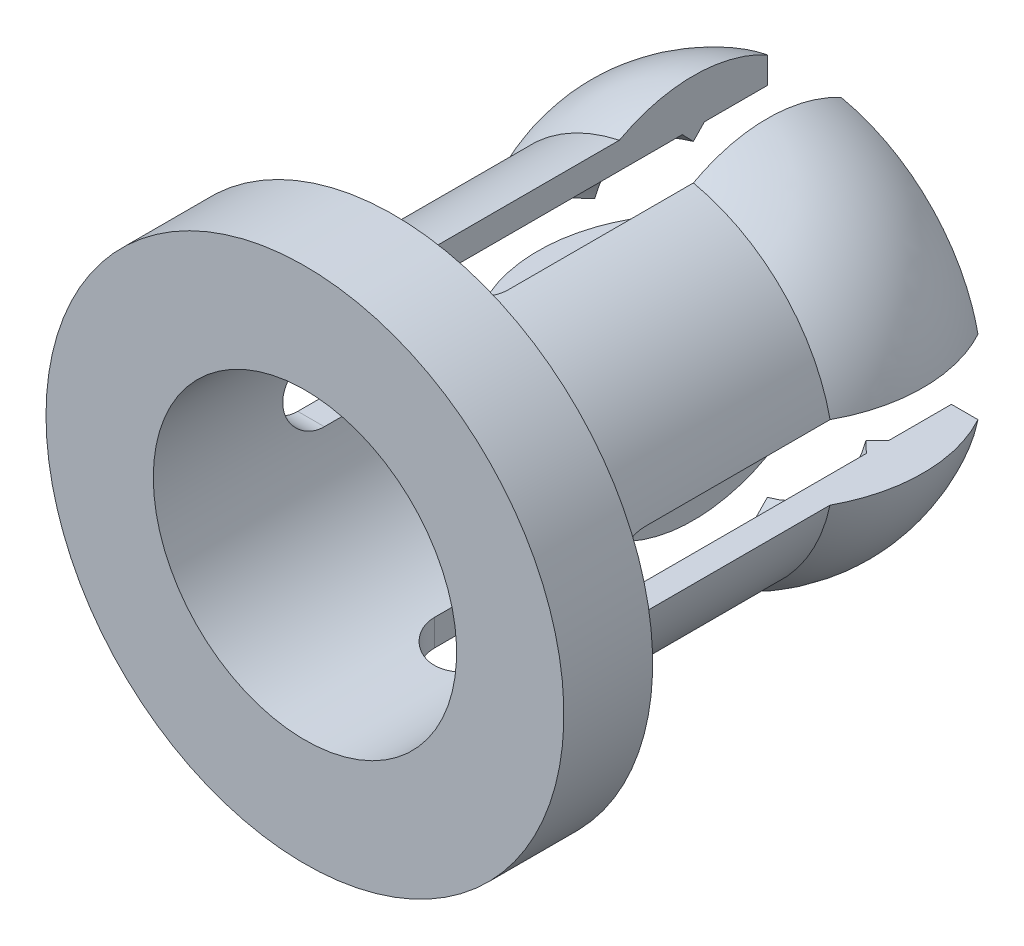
ISO-10303-21;
HEADER;
FILE_DESCRIPTION(('STEP AP214'),'2;1');
FILE_NAME('part.step','',(''),(''),'','','');
FILE_SCHEMA(('AUTOMOTIVE_DESIGN { 1 0 10303 214 1 1 1 1 }'));
ENDSEC;
DATA;
#1=APPLICATION_CONTEXT('core data for automotive mechanical design processes');
#2=APPLICATION_PROTOCOL_DEFINITION('international standard','automotive_design',2000,#1);
#3=PRODUCT_CONTEXT('',#1,'mechanical');
#4=PRODUCT('Part','Part','',(#3));
#5=PRODUCT_RELATED_PRODUCT_CATEGORY('part','',(#4));
#6=PRODUCT_DEFINITION_FORMATION('','',#4);
#7=PRODUCT_DEFINITION_CONTEXT('part definition',#1,'design');
#8=PRODUCT_DEFINITION('design','',#6,#7);
#9=PRODUCT_DEFINITION_SHAPE('','',#8);
#10=(LENGTH_UNIT() NAMED_UNIT(*) SI_UNIT(.MILLI.,.METRE.));
#11=(NAMED_UNIT(*) PLANE_ANGLE_UNIT() SI_UNIT($,.RADIAN.));
#12=(NAMED_UNIT(*) SI_UNIT($,.STERADIAN.) SOLID_ANGLE_UNIT());
#13=UNCERTAINTY_MEASURE_WITH_UNIT(LENGTH_MEASURE(1.E-05),#10,'distance_accuracy_value','');
#14=(GEOMETRIC_REPRESENTATION_CONTEXT(3) GLOBAL_UNCERTAINTY_ASSIGNED_CONTEXT((#13)) GLOBAL_UNIT_ASSIGNED_CONTEXT((#10,
#11,#12)) REPRESENTATION_CONTEXT('',''));
#15=CARTESIAN_POINT('',(0.,0.,0.));
#16=DIRECTION('',(0.,0.,1.));
#17=DIRECTION('',(1.,0.,0.));
#18=AXIS2_PLACEMENT_3D('',#15,#16,#17);
#19=CARTESIAN_POINT('',(0.,0.,0.));
#20=DIRECTION('',(0.,0.,-1.));
#21=DIRECTION('',(-1.,0.,0.));
#22=AXIS2_PLACEMENT_3D('',#19,#20,#21);
#23=CYLINDRICAL_SURFACE('',#22,2.05);
#24=CARTESIAN_POINT('',(0.,0.,-5.89999999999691));
#25=DIRECTION('',(0.,0.,-1.));
#26=DIRECTION('',(1.,0.,0.));
#27=AXIS2_PLACEMENT_3D('',#24,#25,#26);
#28=CIRCLE('',#27,2.05000000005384);
#29=CARTESIAN_POINT('',(0.5,-1.98808953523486,-5.89999999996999));
#30=VERTEX_POINT('',#29);
#31=CARTESIAN_POINT('',(1.98808953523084,-0.5,-5.89999999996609));
#32=VERTEX_POINT('',#31);
#33=EDGE_CURVE('E522',#30,#32,#28,.F.);
#34=ORIENTED_EDGE('',*,*,#33,.T.);
#35=DIRECTION('',(0.,0.,-1.));
#36=VECTOR('',#35,1.);
#37=CARTESIAN_POINT('',(1.9880895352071,-0.5,0.));
#38=LINE('',#37,#36);
#39=CARTESIAN_POINT('',(1.9880895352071,-0.5,-6.75));
#40=VERTEX_POINT('',#39);
#41=EDGE_CURVE('E206',#40,#32,#38,.F.);
#42=ORIENTED_EDGE('',*,*,#41,.F.);
#43=CARTESIAN_POINT('',(0.,0.,-6.75));
#44=DIRECTION('',(0.,0.,-1.));
#45=DIRECTION('',(-1.,0.,0.));
#46=AXIS2_PLACEMENT_3D('',#43,#44,#45);
#47=CIRCLE('',#46,2.05);
#48=CARTESIAN_POINT('',(0.5,-1.9880895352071,-6.75));
#49=VERTEX_POINT('',#48);
#50=EDGE_CURVE('E20',#40,#49,#47,.T.);
#51=ORIENTED_EDGE('',*,*,#50,.T.);
#52=DIRECTION('',(0.,0.,-1.));
#53=VECTOR('',#52,1.);
#54=CARTESIAN_POINT('',(0.500000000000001,-1.9880895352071,0.));
#55=LINE('',#54,#53);
#56=EDGE_CURVE('E211',#30,#49,#55,.T.);
#57=ORIENTED_EDGE('',*,*,#56,.F.);
#58=EDGE_LOOP('',(#34,#42,#51,#57));
#59=FACE_BOUND('',#58,.T.);
#60=ADVANCED_FACE('F17',(#59),#23,.F.);
#61=CARTESIAN_POINT('',(0.,0.,-6.75));
#62=DIRECTION('',(0.,0.,1.));
#63=DIRECTION('',(1.,0.,0.));
#64=AXIS2_PLACEMENT_3D('',#61,#62,#63);
#65=PLANE('',#64);
#66=ORIENTED_EDGE('',*,*,#50,.F.);
#67=DIRECTION('',(1.,0.,0.));
#68=VECTOR('',#67,1.);
#69=CARTESIAN_POINT('',(0.,-0.5,-6.75));
#70=LINE('',#69,#68);
#71=CARTESIAN_POINT('',(2.3473389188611,-0.5,-6.75));
#72=VERTEX_POINT('',#71);
#73=EDGE_CURVE('E222',#72,#40,#70,.F.);
#74=ORIENTED_EDGE('',*,*,#73,.F.);
#75=CARTESIAN_POINT('',(2.3473389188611,-0.500000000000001,-6.75));
#76=CARTESIAN_POINT('',(2.33328136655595,-0.56602678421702,-6.75));
#77=CARTESIAN_POINT('',(2.31642607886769,-0.631454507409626,-6.75));
#78=CARTESIAN_POINT('',(2.27726835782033,-0.760655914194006,-6.75));
#79=CARTESIAN_POINT('',(2.25496617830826,-0.824429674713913,-6.75));
#80=CARTESIAN_POINT('',(2.20508260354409,-0.949820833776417,-6.75));
#81=CARTESIAN_POINT('',(2.17750565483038,-1.01143999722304,-6.75));
#82=CARTESIAN_POINT('',(2.11727458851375,-1.1321230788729,-6.75));
#83=CARTESIAN_POINT('',(2.08462054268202,-1.19118703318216,-6.75));
#84=CARTESIAN_POINT('',(1.9793348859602,-1.36395928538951,-6.75));
#85=CARTESIAN_POINT('',(1.89935483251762,-1.47331045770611,-6.75));
#86=CARTESIAN_POINT('',(1.72219904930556,-1.67698278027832,-6.75));
#87=CARTESIAN_POINT('',(1.62502175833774,-1.77130256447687,-6.75));
#88=CARTESIAN_POINT('',(1.41617052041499,-1.94234113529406,-6.75));
#89=CARTESIAN_POINT('',(1.30448954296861,-2.0190513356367,-6.75));
#90=CARTESIAN_POINT('',(1.06987648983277,-2.15256537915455,-6.75));
#91=CARTESIAN_POINT('',(0.946956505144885,-2.20939030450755,-6.75000000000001));
#92=CARTESIAN_POINT('',(0.767993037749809,-2.2744885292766,-6.75));
#93=CARTESIAN_POINT('',(0.715056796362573,-2.29167933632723,-6.75));
#94=CARTESIAN_POINT('',(0.608221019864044,-2.32231414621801,-6.75));
#95=CARTESIAN_POINT('',(0.554323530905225,-2.33576528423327,-6.75));
#96=CARTESIAN_POINT('',(0.5,-2.3473389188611,-6.75));
#97=B_SPLINE_CURVE_WITH_KNOTS('',3,(#75,#76,#77,#78,#79,#80,#81,#82,#83,#84,#85,#86,#87,#88,#89,
#90,#91,#92,#93,#94,#95,#96),.UNSPECIFIED.,.F.,.F.,(4,2,2,2,2,2,2,2,2,2,4),(0.,
0.202454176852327,0.404898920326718,0.607173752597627,0.809445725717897,1.21379039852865,
1.61817179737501,2.0227499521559,2.42689786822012,2.593762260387,2.76030606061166),.UNSPECIFIED.);
#98=CARTESIAN_POINT('',(0.5,-2.3473389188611,-6.75));
#99=VERTEX_POINT('',#98);
#100=EDGE_CURVE('E228',#72,#99,#97,.T.);
#101=ORIENTED_EDGE('',*,*,#100,.T.);
#102=DIRECTION('',(0.,1.,0.));
#103=VECTOR('',#102,1.);
#104=CARTESIAN_POINT('',(0.5,0.,-6.75));
#105=LINE('',#104,#103);
#106=EDGE_CURVE('E216',#49,#99,#105,.F.);
#107=ORIENTED_EDGE('',*,*,#106,.F.);
#108=EDGE_LOOP('',(#66,#74,#101,#107));
#109=FACE_BOUND('',#108,.T.);
#110=ADVANCED_FACE('F225',(#109),#65,.F.);
#111=CARTESIAN_POINT('',(0.,0.,0.));
#112=DIRECTION('',(0.,0.,-1.));
#113=DIRECTION('',(-1.,0.,0.));
#114=AXIS2_PLACEMENT_3D('',#111,#112,#113);
#115=CYLINDRICAL_SURFACE('',#114,2.05);
#116=CARTESIAN_POINT('',(0.,0.,-6.75));
#117=DIRECTION('',(0.,0.,-1.));
#118=DIRECTION('',(-1.,0.,0.));
#119=AXIS2_PLACEMENT_3D('',#116,#117,#118);
#120=CIRCLE('',#119,2.05);
#121=CARTESIAN_POINT('',(0.500000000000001,1.9880895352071,-6.75));
#122=VERTEX_POINT('',#121);
#123=CARTESIAN_POINT('',(1.9880895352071,0.5,-6.75));
#124=VERTEX_POINT('',#123);
#125=EDGE_CURVE('E550',#122,#124,#120,.T.);
#126=ORIENTED_EDGE('',*,*,#125,.T.);
#127=DIRECTION('',(0.,0.,-1.));
#128=VECTOR('',#127,1.);
#129=CARTESIAN_POINT('',(1.9880895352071,0.5,0.));
#130=LINE('',#129,#128);
#131=CARTESIAN_POINT('',(1.98808953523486,0.5,-5.89999999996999));
#132=VERTEX_POINT('',#131);
#133=EDGE_CURVE('E230',#132,#124,#130,.T.);
#134=ORIENTED_EDGE('',*,*,#133,.F.);
#135=CARTESIAN_POINT('',(0.,0.,-5.89999999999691));
#136=DIRECTION('',(0.,0.,-1.));
#137=DIRECTION('',(1.,0.,0.));
#138=AXIS2_PLACEMENT_3D('',#135,#136,#137);
#139=CIRCLE('',#138,2.05000000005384);
#140=CARTESIAN_POINT('',(0.500000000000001,1.98808953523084,-5.89999999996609));
#141=VERTEX_POINT('',#140);
#142=EDGE_CURVE('E420',#132,#141,#139,.F.);
#143=ORIENTED_EDGE('',*,*,#142,.T.);
#144=DIRECTION('',(0.,0.,-1.));
#145=VECTOR('',#144,1.);
#146=CARTESIAN_POINT('',(0.500000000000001,1.9880895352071,0.));
#147=LINE('',#146,#145);
#148=EDGE_CURVE('E551',#122,#141,#147,.F.);
#149=ORIENTED_EDGE('',*,*,#148,.F.);
#150=EDGE_LOOP('',(#126,#134,#143,#149));
#151=FACE_BOUND('',#150,.T.);
#152=ADVANCED_FACE('F885',(#151),#115,.F.);
#153=CARTESIAN_POINT('',(0.,0.,-6.75));
#154=DIRECTION('',(0.,0.,1.));
#155=DIRECTION('',(1.,0.,0.));
#156=AXIS2_PLACEMENT_3D('',#153,#154,#155);
#157=PLANE('',#156);
#158=CARTESIAN_POINT('',(0.500000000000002,2.3473389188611,-6.75));
#159=CARTESIAN_POINT('',(0.566026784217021,2.33328136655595,-6.75));
#160=CARTESIAN_POINT('',(0.631454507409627,2.31642607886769,-6.75));
#161=CARTESIAN_POINT('',(0.760655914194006,2.27726835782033,-6.75));
#162=CARTESIAN_POINT('',(0.824429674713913,2.25496617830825,-6.75));
#163=CARTESIAN_POINT('',(0.949820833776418,2.20508260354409,-6.75));
#164=CARTESIAN_POINT('',(1.01143999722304,2.17750565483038,-6.75));
#165=CARTESIAN_POINT('',(1.1321230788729,2.11727458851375,-6.75));
#166=CARTESIAN_POINT('',(1.19118703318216,2.08462054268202,-6.75));
#167=CARTESIAN_POINT('',(1.36395928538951,1.9793348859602,-6.75));
#168=CARTESIAN_POINT('',(1.47331045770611,1.89935483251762,-6.75));
#169=CARTESIAN_POINT('',(1.67698278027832,1.72219904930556,-6.75));
#170=CARTESIAN_POINT('',(1.77130256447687,1.62502175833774,-6.75));
#171=CARTESIAN_POINT('',(1.94234113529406,1.41617052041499,-6.75));
#172=CARTESIAN_POINT('',(2.0190513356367,1.30448954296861,-6.75));
#173=CARTESIAN_POINT('',(2.15256537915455,1.06987648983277,-6.75));
#174=CARTESIAN_POINT('',(2.20939030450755,0.946956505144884,-6.75));
#175=CARTESIAN_POINT('',(2.2744885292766,0.767993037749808,-6.75));
#176=CARTESIAN_POINT('',(2.29167933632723,0.715056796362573,-6.75));
#177=CARTESIAN_POINT('',(2.32231414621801,0.608221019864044,-6.75));
#178=CARTESIAN_POINT('',(2.33576528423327,0.554323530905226,-6.75));
#179=CARTESIAN_POINT('',(2.3473389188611,0.500000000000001,-6.75));
#180=B_SPLINE_CURVE_WITH_KNOTS('',3,(#158,#159,#160,#161,#162,#163,#164,#165,#166,#167,#168,
#169,#170,#171,#172,#173,#174,#175,#176,#177,#178,#179),.UNSPECIFIED.,.F.,.F.,(4,2,2,2,2,2,2,2,
2,2,4),(0.,0.202454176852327,0.404898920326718,0.607173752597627,0.809445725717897,
1.21379039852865,1.61817179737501,2.02274995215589,2.42689786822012,2.593762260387,
2.76030606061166),.UNSPECIFIED.);
#181=CARTESIAN_POINT('',(0.500000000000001,2.3473389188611,-6.75));
#182=VERTEX_POINT('',#181);
#183=CARTESIAN_POINT('',(2.3473389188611,0.5,-6.75));
#184=VERTEX_POINT('',#183);
#185=EDGE_CURVE('E419',#182,#184,#180,.T.);
#186=ORIENTED_EDGE('',*,*,#185,.T.);
#187=DIRECTION('',(1.,0.,0.));
#188=VECTOR('',#187,1.);
#189=CARTESIAN_POINT('',(0.,0.5,-6.75));
#190=LINE('',#189,#188);
#191=EDGE_CURVE('E548',#124,#184,#190,.T.);
#192=ORIENTED_EDGE('',*,*,#191,.F.);
#193=ORIENTED_EDGE('',*,*,#125,.F.);
#194=DIRECTION('',(0.,1.,0.));
#195=VECTOR('',#194,1.);
#196=CARTESIAN_POINT('',(0.5,0.,-6.75));
#197=LINE('',#196,#195);
#198=EDGE_CURVE('E545',#182,#122,#197,.F.);
#199=ORIENTED_EDGE('',*,*,#198,.F.);
#200=EDGE_LOOP('',(#186,#192,#193,#199));
#201=FACE_BOUND('',#200,.T.);
#202=ADVANCED_FACE('F881',(#201),#157,.F.);
#203=CARTESIAN_POINT('',(0.,0.,0.));
#204=DIRECTION('',(0.,0.,-1.));
#205=DIRECTION('',(-1.,0.,0.));
#206=AXIS2_PLACEMENT_3D('',#203,#204,#205);
#207=CYLINDRICAL_SURFACE('',#206,2.05);
#208=CARTESIAN_POINT('',(0.,0.,-5.89999999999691));
#209=DIRECTION('',(0.,0.,-1.));
#210=DIRECTION('',(1.,0.,0.));
#211=AXIS2_PLACEMENT_3D('',#208,#209,#210);
#212=CIRCLE('',#211,2.05000000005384);
#213=CARTESIAN_POINT('',(-0.500000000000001,1.98808953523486,-5.89999999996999));
#214=VERTEX_POINT('',#213);
#215=CARTESIAN_POINT('',(-1.98808953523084,0.5,-5.89999999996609));
#216=VERTEX_POINT('',#215);
#217=EDGE_CURVE('E509',#214,#216,#212,.F.);
#218=ORIENTED_EDGE('',*,*,#217,.T.);
#219=DIRECTION('',(0.,0.,-1.));
#220=VECTOR('',#219,1.);
#221=CARTESIAN_POINT('',(-1.9880895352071,0.500000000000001,0.));
#222=LINE('',#221,#220);
#223=CARTESIAN_POINT('',(-1.9880895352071,0.5,-6.75));
#224=VERTEX_POINT('',#223);
#225=EDGE_CURVE('E543',#224,#216,#222,.F.);
#226=ORIENTED_EDGE('',*,*,#225,.F.);
#227=CARTESIAN_POINT('',(0.,0.,-6.75));
#228=DIRECTION('',(0.,0.,-1.));
#229=DIRECTION('',(-1.,0.,0.));
#230=AXIS2_PLACEMENT_3D('',#227,#228,#229);
#231=CIRCLE('',#230,2.05);
#232=CARTESIAN_POINT('',(-0.5,1.9880895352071,-6.75));
#233=VERTEX_POINT('',#232);
#234=EDGE_CURVE('E537',#224,#233,#231,.T.);
#235=ORIENTED_EDGE('',*,*,#234,.T.);
#236=DIRECTION('',(0.,0.,-1.));
#237=VECTOR('',#236,1.);
#238=CARTESIAN_POINT('',(-0.500000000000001,1.9880895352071,0.));
#239=LINE('',#238,#237);
#240=EDGE_CURVE('E541',#214,#233,#239,.T.);
#241=ORIENTED_EDGE('',*,*,#240,.F.);
#242=EDGE_LOOP('',(#218,#226,#235,#241));
#243=FACE_BOUND('',#242,.T.);
#244=ADVANCED_FACE('F836',(#243),#207,.F.);
#245=CARTESIAN_POINT('',(0.,0.,-6.75));
#246=DIRECTION('',(0.,0.,1.));
#247=DIRECTION('',(1.,0.,0.));
#248=AXIS2_PLACEMENT_3D('',#245,#246,#247);
#249=PLANE('',#248);
#250=ORIENTED_EDGE('',*,*,#234,.F.);
#251=DIRECTION('',(1.,0.,0.));
#252=VECTOR('',#251,1.);
#253=CARTESIAN_POINT('',(0.,0.5,-6.75));
#254=LINE('',#253,#252);
#255=CARTESIAN_POINT('',(-2.3473389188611,0.5,-6.75));
#256=VERTEX_POINT('',#255);
#257=EDGE_CURVE('E538',#256,#224,#254,.T.);
#258=ORIENTED_EDGE('',*,*,#257,.F.);
#259=CARTESIAN_POINT('',(-2.3473389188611,0.5,-6.75));
#260=CARTESIAN_POINT('',(-2.33328136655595,0.566026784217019,-6.75));
#261=CARTESIAN_POINT('',(-2.31642607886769,0.631454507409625,-6.75));
#262=CARTESIAN_POINT('',(-2.27726835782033,0.760655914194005,-6.75));
#263=CARTESIAN_POINT('',(-2.25496617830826,0.824429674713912,-6.75));
#264=CARTESIAN_POINT('',(-2.20508260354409,0.949820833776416,-6.75));
#265=CARTESIAN_POINT('',(-2.17750565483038,1.01143999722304,-6.75));
#266=CARTESIAN_POINT('',(-2.11727458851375,1.1321230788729,-6.75));
#267=CARTESIAN_POINT('',(-2.08462054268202,1.19118703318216,-6.75));
#268=CARTESIAN_POINT('',(-1.9793348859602,1.36395928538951,-6.75));
#269=CARTESIAN_POINT('',(-1.89935483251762,1.47331045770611,-6.75));
#270=CARTESIAN_POINT('',(-1.72219904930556,1.67698278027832,-6.75));
#271=CARTESIAN_POINT('',(-1.62502175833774,1.77130256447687,-6.75));
#272=CARTESIAN_POINT('',(-1.41617052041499,1.94234113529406,-6.75));
#273=CARTESIAN_POINT('',(-1.30448954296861,2.0190513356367,-6.75));
#274=CARTESIAN_POINT('',(-1.06987648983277,2.15256537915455,-6.75));
#275=CARTESIAN_POINT('',(-0.946956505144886,2.20939030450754,-6.75));
#276=CARTESIAN_POINT('',(-0.76799303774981,2.2744885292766,-6.75));
#277=CARTESIAN_POINT('',(-0.715056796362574,2.29167933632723,-6.75));
#278=CARTESIAN_POINT('',(-0.608221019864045,2.32231414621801,-6.75));
#279=CARTESIAN_POINT('',(-0.554323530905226,2.33576528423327,-6.75));
#280=CARTESIAN_POINT('',(-0.500000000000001,2.3473389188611,-6.75));
#281=B_SPLINE_CURVE_WITH_KNOTS('',3,(#259,#260,#261,#262,#263,#264,#265,#266,#267,#268,#269,
#270,#271,#272,#273,#274,#275,#276,#277,#278,#279,#280),.UNSPECIFIED.,.F.,.F.,(4,2,2,2,2,2,2,2,
2,2,4),(0.,0.202454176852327,0.404898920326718,0.607173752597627,0.809445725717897,
1.21379039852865,1.61817179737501,2.02274995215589,2.42689786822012,2.593762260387,
2.76030606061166),.UNSPECIFIED.);
#282=CARTESIAN_POINT('',(-0.5,2.3473389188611,-6.75));
#283=VERTEX_POINT('',#282);
#284=EDGE_CURVE('E732',#256,#283,#281,.T.);
#285=ORIENTED_EDGE('',*,*,#284,.T.);
#286=DIRECTION('',(0.,1.,0.));
#287=VECTOR('',#286,1.);
#288=CARTESIAN_POINT('',(-0.5,0.,-6.75));
#289=LINE('',#288,#287);
#290=EDGE_CURVE('E534',#233,#283,#289,.T.);
#291=ORIENTED_EDGE('',*,*,#290,.F.);
#292=EDGE_LOOP('',(#250,#258,#285,#291));
#293=FACE_BOUND('',#292,.T.);
#294=ADVANCED_FACE('F744',(#293),#249,.F.);
#295=CARTESIAN_POINT('',(0.,0.,0.));
#296=DIRECTION('',(0.,0.,-1.));
#297=DIRECTION('',(-1.,0.,0.));
#298=AXIS2_PLACEMENT_3D('',#295,#296,#297);
#299=CYLINDRICAL_SURFACE('',#298,2.05);
#300=CARTESIAN_POINT('',(0.,0.,-6.75));
#301=DIRECTION('',(0.,0.,-1.));
#302=DIRECTION('',(-1.,0.,0.));
#303=AXIS2_PLACEMENT_3D('',#300,#301,#302);
#304=CIRCLE('',#303,2.05);
#305=CARTESIAN_POINT('',(-0.5,-1.9880895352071,-6.75));
#306=VERTEX_POINT('',#305);
#307=CARTESIAN_POINT('',(-1.9880895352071,-0.5,-6.75));
#308=VERTEX_POINT('',#307);
#309=EDGE_CURVE('E530',#306,#308,#304,.T.);
#310=ORIENTED_EDGE('',*,*,#309,.T.);
#311=DIRECTION('',(0.,0.,-1.));
#312=VECTOR('',#311,1.);
#313=CARTESIAN_POINT('',(-1.9880895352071,-0.500000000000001,0.));
#314=LINE('',#313,#312);
#315=CARTESIAN_POINT('',(-1.98808953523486,-0.5,-5.89999999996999));
#316=VERTEX_POINT('',#315);
#317=EDGE_CURVE('E531',#316,#308,#314,.T.);
#318=ORIENTED_EDGE('',*,*,#317,.F.);
#319=CARTESIAN_POINT('',(0.,0.,-5.89999999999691));
#320=DIRECTION('',(0.,0.,-1.));
#321=DIRECTION('',(1.,0.,0.));
#322=AXIS2_PLACEMENT_3D('',#319,#320,#321);
#323=CIRCLE('',#322,2.05000000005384);
#324=CARTESIAN_POINT('',(-0.5,-1.98808953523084,-5.89999999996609));
#325=VERTEX_POINT('',#324);
#326=EDGE_CURVE('E496',#316,#325,#323,.F.);
#327=ORIENTED_EDGE('',*,*,#326,.T.);
#328=DIRECTION('',(0.,0.,-1.));
#329=VECTOR('',#328,1.);
#330=CARTESIAN_POINT('',(-0.5,-1.9880895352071,0.));
#331=LINE('',#330,#329);
#332=EDGE_CURVE('E533',#306,#325,#331,.F.);
#333=ORIENTED_EDGE('',*,*,#332,.F.);
#334=EDGE_LOOP('',(#310,#318,#327,#333));
#335=FACE_BOUND('',#334,.T.);
#336=ADVANCED_FACE('F871',(#335),#299,.F.);
#337=CARTESIAN_POINT('',(0.,0.,-6.75));
#338=DIRECTION('',(0.,0.,1.));
#339=DIRECTION('',(1.,0.,0.));
#340=AXIS2_PLACEMENT_3D('',#337,#338,#339);
#341=PLANE('',#340);
#342=CARTESIAN_POINT('',(-0.500000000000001,-2.3473389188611,-6.75));
#343=CARTESIAN_POINT('',(-0.56602678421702,-2.33328136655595,-6.75));
#344=CARTESIAN_POINT('',(-0.631454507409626,-2.31642607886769,-6.75));
#345=CARTESIAN_POINT('',(-0.760655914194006,-2.27726835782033,-6.75));
#346=CARTESIAN_POINT('',(-0.824429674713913,-2.25496617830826,-6.75));
#347=CARTESIAN_POINT('',(-0.949820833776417,-2.20508260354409,-6.75));
#348=CARTESIAN_POINT('',(-1.01143999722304,-2.17750565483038,-6.75));
#349=CARTESIAN_POINT('',(-1.1321230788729,-2.11727458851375,-6.75));
#350=CARTESIAN_POINT('',(-1.19118703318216,-2.08462054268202,-6.75));
#351=CARTESIAN_POINT('',(-1.36395928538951,-1.9793348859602,-6.75));
#352=CARTESIAN_POINT('',(-1.47331045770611,-1.89935483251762,-6.75));
#353=CARTESIAN_POINT('',(-1.67698278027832,-1.72219904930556,-6.75));
#354=CARTESIAN_POINT('',(-1.77130256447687,-1.62502175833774,-6.75));
#355=CARTESIAN_POINT('',(-1.94234113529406,-1.41617052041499,-6.75));
#356=CARTESIAN_POINT('',(-2.0190513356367,-1.30448954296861,-6.75));
#357=CARTESIAN_POINT('',(-2.15256537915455,-1.06987648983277,-6.75));
#358=CARTESIAN_POINT('',(-2.20939030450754,-0.946956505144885,-6.75));
#359=CARTESIAN_POINT('',(-2.2744885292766,-0.767993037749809,-6.75));
#360=CARTESIAN_POINT('',(-2.29167933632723,-0.715056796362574,-6.75));
#361=CARTESIAN_POINT('',(-2.32231414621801,-0.608221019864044,-6.75));
#362=CARTESIAN_POINT('',(-2.33576528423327,-0.554323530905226,-6.75));
#363=CARTESIAN_POINT('',(-2.3473389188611,-0.5,-6.75));
#364=B_SPLINE_CURVE_WITH_KNOTS('',3,(#342,#343,#344,#345,#346,#347,#348,#349,#350,#351,#352,
#353,#354,#355,#356,#357,#358,#359,#360,#361,#362,#363),.UNSPECIFIED.,.F.,.F.,(4,2,2,2,2,2,2,2,
2,2,4),(0.,0.202454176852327,0.404898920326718,0.607173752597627,0.809445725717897,
1.21379039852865,1.61817179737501,2.02274995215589,2.42689786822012,2.593762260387,
2.76030606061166),.UNSPECIFIED.);
#365=CARTESIAN_POINT('',(-0.5,-2.3473389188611,-6.75));
#366=VERTEX_POINT('',#365);
#367=CARTESIAN_POINT('',(-2.3473389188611,-0.5,-6.75));
#368=VERTEX_POINT('',#367);
#369=EDGE_CURVE('E518',#366,#368,#364,.T.);
#370=ORIENTED_EDGE('',*,*,#369,.T.);
#371=DIRECTION('',(1.,0.,0.));
#372=VECTOR('',#371,1.);
#373=CARTESIAN_POINT('',(0.,-0.5,-6.75));
#374=LINE('',#373,#372);
#375=EDGE_CURVE('E528',#308,#368,#374,.F.);
#376=ORIENTED_EDGE('',*,*,#375,.F.);
#377=ORIENTED_EDGE('',*,*,#309,.F.);
#378=DIRECTION('',(0.,1.,0.));
#379=VECTOR('',#378,1.);
#380=CARTESIAN_POINT('',(-0.5,0.,-6.75));
#381=LINE('',#380,#379);
#382=EDGE_CURVE('E525',#366,#306,#381,.T.);
#383=ORIENTED_EDGE('',*,*,#382,.F.);
#384=EDGE_LOOP('',(#370,#376,#377,#383));
#385=FACE_BOUND('',#384,.T.);
#386=ADVANCED_FACE('F863',(#385),#341,.F.);
#387=CARTESIAN_POINT('',(0.,0.,-1.2));
#388=DIRECTION('',(0.,0.,1.));
#389=DIRECTION('',(1.,0.,0.));
#390=AXIS2_PLACEMENT_3D('',#387,#388,#389);
#391=PLANE('',#390);
#392=CARTESIAN_POINT('',(0.,0.,-1.2));
#393=DIRECTION('',(0.,0.,-1.));
#394=DIRECTION('',(-1.,0.,0.));
#395=AXIS2_PLACEMENT_3D('',#392,#393,#394);
#396=CIRCLE('',#395,2.4);
#397=CARTESIAN_POINT('',(-2.4,0.,-1.2));
#398=VERTEX_POINT('',#397);
#399=EDGE_CURVE('E491',#398,#398,#396,.T.);
#400=ORIENTED_EDGE('',*,*,#399,.F.);
#401=EDGE_LOOP('',(#400));
#402=FACE_BOUND('',#401,.T.);
#403=CARTESIAN_POINT('',(0.,0.,-1.2));
#404=DIRECTION('',(0.,0.,-1.));
#405=DIRECTION('',(-1.,0.,0.));
#406=AXIS2_PLACEMENT_3D('',#403,#404,#405);
#407=CIRCLE('',#406,3.5);
#408=CARTESIAN_POINT('',(-3.5,0.,-1.2));
#409=VERTEX_POINT('',#408);
#410=EDGE_CURVE('E500',#409,#409,#407,.F.);
#411=ORIENTED_EDGE('',*,*,#410,.F.);
#412=EDGE_LOOP('',(#411));
#413=FACE_BOUND('',#412,.T.);
#414=ADVANCED_FACE('F568',(#402,#413),#391,.F.);
#415=CARTESIAN_POINT('',(0.,0.,-5.89999999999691));
#416=DIRECTION('',(0.,0.,-1.));
#417=DIRECTION('',(0.,1.,0.));
#418=AXIS2_PLACEMENT_3D('',#415,#416,#417);
#419=CONICAL_SURFACE('',#418,2.05000000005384,0.785398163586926);
#420=CARTESIAN_POINT('',(0.,0.,-5.75000000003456));
#421=DIRECTION('',(0.,0.,1.));
#422=DIRECTION('',(1.,0.,0.));
#423=AXIS2_PLACEMENT_3D('',#420,#421,#422);
#424=CIRCLE('',#423,1.89999999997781);
#425=CARTESIAN_POINT('',(0.5,-1.83303027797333,-5.75000000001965));
#426=VERTEX_POINT('',#425);
#427=CARTESIAN_POINT('',(1.83303027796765,-0.5,-5.75000000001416));
#428=VERTEX_POINT('',#427);
#429=EDGE_CURVE('E487',#426,#428,#424,.T.);
#430=ORIENTED_EDGE('',*,*,#429,.T.);
#431=CARTESIAN_POINT('',(1.98808953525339,-0.499999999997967,-5.89999999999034));
#432=CARTESIAN_POINT('',(1.96227886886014,-0.499999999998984,-5.87496636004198));
#433=CARTESIAN_POINT('',(1.93645193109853,-0.499999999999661,-5.84994954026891));
#434=CARTESIAN_POINT('',(1.88476551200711,-0.500000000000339,-5.79994954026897));
#435=CARTESIAN_POINT('',(1.85890603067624,-0.500000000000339,-5.77496636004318));
#436=CARTESIAN_POINT('',(1.83303027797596,-0.5,-5.74999999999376));
#437=B_SPLINE_CURVE_WITH_KNOTS('',3,(#431,#432,#433,#434,#435,#436),.UNSPECIFIED.,.F.,.F.,(4,2,
4),(0.,0.107869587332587,0.215739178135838),.UNSPECIFIED.);
#438=EDGE_CURVE('E524',#32,#428,#437,.T.);
#439=ORIENTED_EDGE('',*,*,#438,.F.);
#440=ORIENTED_EDGE('',*,*,#33,.F.);
#441=CARTESIAN_POINT('',(0.5,-1.9880895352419,-5.89999999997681));
#442=CARTESIAN_POINT('',(0.5,-1.96227886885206,-5.87496636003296));
#443=CARTESIAN_POINT('',(0.5,-1.93645193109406,-5.84994954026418));
#444=CARTESIAN_POINT('',(0.5,-1.88476551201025,-5.7999495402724));
#445=CARTESIAN_POINT('',(0.5,-1.85890603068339,-5.77496636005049));
#446=CARTESIAN_POINT('',(0.5,-1.83303027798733,-5.75000000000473));
#447=B_SPLINE_CURVE_WITH_KNOTS('',3,(#441,#442,#443,#444,#445,#446),.UNSPECIFIED.,.F.,.F.,(4,2,
4),(0.,0.107869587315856,0.215739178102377),.UNSPECIFIED.);
#448=EDGE_CURVE('E220',#30,#426,#447,.T.);
#449=ORIENTED_EDGE('',*,*,#448,.T.);
#450=EDGE_LOOP('',(#430,#439,#440,#449));
#451=FACE_BOUND('',#450,.T.);
#452=ADVANCED_FACE('F564',(#451),#419,.F.);
#453=CARTESIAN_POINT('',(0.426386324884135,-2.36197370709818,-6.75));
#454=CARTESIAN_POINT('',(0.439608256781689,-2.35943337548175,-6.75));
#455=CARTESIAN_POINT('',(0.452830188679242,-2.35689304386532,-6.75));
#456=CARTESIAN_POINT('',(2.05002397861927,-2.05002397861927,-6.75));
#457=CARTESIAN_POINT('',(2.35689304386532,-0.452830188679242,-6.75));
#458=CARTESIAN_POINT('',(2.35943337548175,-0.439608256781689,-6.75));
#459=CARTESIAN_POINT('',(2.36197370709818,-0.426386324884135,-6.75));
#460=CARTESIAN_POINT('',(0.521138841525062,-2.88685675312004,-5.75));
#461=CARTESIAN_POINT('',(0.53729898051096,-2.88375190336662,-5.75));
#462=CARTESIAN_POINT('',(0.553459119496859,-2.88064705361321,-5.75));
#463=CARTESIAN_POINT('',(2.50558486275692,-2.50558486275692,-5.75));
#464=CARTESIAN_POINT('',(2.88064705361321,-0.55345911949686,-5.75));
#465=CARTESIAN_POINT('',(2.88375190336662,-0.537298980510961,-5.75));
#466=CARTESIAN_POINT('',(2.88685675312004,-0.521138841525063,-5.75));
#467=CARTESIAN_POINT('',(0.426386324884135,-2.36197370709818,-4.75));
#468=CARTESIAN_POINT('',(0.439608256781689,-2.35943337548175,-4.75));
#469=CARTESIAN_POINT('',(0.452830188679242,-2.35689304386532,-4.75));
#470=CARTESIAN_POINT('',(2.05002397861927,-2.05002397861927,-4.75));
#471=CARTESIAN_POINT('',(2.35689304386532,-0.452830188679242,-4.75));
#472=CARTESIAN_POINT('',(2.35943337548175,-0.439608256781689,-4.75));
#473=CARTESIAN_POINT('',(2.36197370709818,-0.426386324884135,-4.75));
#474=(BOUNDED_SURFACE() B_SPLINE_SURFACE(2,2,((#453,#454,#455,#456,#457,#458,#459),(#460,#461,
#462,#463,#464,#465,#466),(#467,#468,#469,#470,#471,#472,#473)),.UNSPECIFIED.,.F.,.F.,
.F.) B_SPLINE_SURFACE_WITH_KNOTS((3,3),(3,2,2,3),(-0.489957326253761,0.489957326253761),
(-1.39289088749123,-1.38097926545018,-0.189817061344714,-0.177905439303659),
.UNSPECIFIED.) GEOMETRIC_REPRESENTATION_ITEM() RATIONAL_B_SPLINE_SURFACE(((1.,1.,1.,
0.827822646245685,1.,1.,1.),(0.882352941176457,0.882352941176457,0.882352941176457,
0.730431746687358,0.882352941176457,0.882352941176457,0.882352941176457),(1.,1.,1.,
0.827822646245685,1.,1.,1.))) REPRESENTATION_ITEM('') SURFACE());
#475=CARTESIAN_POINT('',(2.3473389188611,-0.500000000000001,-6.75));
#476=CARTESIAN_POINT('',(2.39021553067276,-0.5,-6.67142594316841));
#477=CARTESIAN_POINT('',(2.42798853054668,-0.5,-6.59010723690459));
#478=CARTESIAN_POINT('',(2.49286098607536,-0.5,-6.4232476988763));
#479=CARTESIAN_POINT('',(2.51995244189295,-0.5,-6.33770375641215));
#480=CARTESIAN_POINT('',(2.5695771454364,-0.5,-6.13688232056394));
#481=CARTESIAN_POINT('',(2.58810803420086,-0.5,-6.02059275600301));
#482=CARTESIAN_POINT('',(2.60538549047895,-0.5,-5.78648624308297));
#483=CARTESIAN_POINT('',(2.60411707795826,-0.5,-5.66866820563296));
#484=CARTESIAN_POINT('',(2.58181598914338,-0.5,-5.43487177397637));
#485=CARTESIAN_POINT('',(2.56077265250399,-0.5,-5.31889440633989));
#486=CARTESIAN_POINT('',(2.4995170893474,-0.5,-5.09225890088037));
#487=CARTESIAN_POINT('',(2.45934214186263,-0.5,-4.98159087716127));
#488=CARTESIAN_POINT('',(2.40048524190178,-0.499999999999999,-4.85399444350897));
#489=CARTESIAN_POINT('',(2.39033661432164,-0.499999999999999,-4.83293256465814));
#490=CARTESIAN_POINT('',(2.36935270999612,-0.500000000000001,-4.79118747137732));
#491=CARTESIAN_POINT('',(2.35851833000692,-0.500000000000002,-4.77050380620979));
#492=CARTESIAN_POINT('',(2.3473389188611,-0.500000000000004,-4.75));
#493=B_SPLINE_CURVE_WITH_KNOTS('',3,(#475,#476,#477,#478,#479,#480,#481,#482,#483,#484,#485,
#486,#487,#488,#489,#490,#491,#492),.UNSPECIFIED.,.F.,.F.,(4,2,2,2,2,2,2,2,4),(0.,
0.268284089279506,0.536768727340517,0.888305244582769,1.24010774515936,1.59210000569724,
1.94340917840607,2.01354170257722,2.08358433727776),.UNSPECIFIED.);
#494=CARTESIAN_POINT('',(2.3473389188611,-0.5,-4.75));
#495=VERTEX_POINT('',#494);
#496=EDGE_CURVE('E323',#72,#495,#493,.T.);
#497=CARTESIAN_POINT('',(0.,0.,-4.75));
#498=DIRECTION('',(0.,0.,-1.));
#499=DIRECTION('',(-1.,0.,0.));
#500=AXIS2_PLACEMENT_3D('',#497,#498,#499);
#501=CIRCLE('',#500,2.4);
#502=CARTESIAN_POINT('',(0.5,-2.3473389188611,-4.75));
#503=VERTEX_POINT('',#502);
#504=EDGE_CURVE('E513',#503,#495,#501,.F.);
#505=CARTESIAN_POINT('',(0.5,-2.3473389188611,-4.75));
#506=CARTESIAN_POINT('',(0.5,-2.39021553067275,-4.82857405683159));
#507=CARTESIAN_POINT('',(0.5,-2.42798853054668,-4.90989276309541));
#508=CARTESIAN_POINT('',(0.5,-2.49286098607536,-5.0767523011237));
#509=CARTESIAN_POINT('',(0.5,-2.51995244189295,-5.16229624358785));
#510=CARTESIAN_POINT('',(0.5,-2.5695771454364,-5.36311767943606));
#511=CARTESIAN_POINT('',(0.5,-2.58810803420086,-5.47940724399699));
#512=CARTESIAN_POINT('',(0.5,-2.60538549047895,-5.71351375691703));
#513=CARTESIAN_POINT('',(0.5,-2.60411707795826,-5.83133179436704));
#514=CARTESIAN_POINT('',(0.5,-2.58181598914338,-6.06512822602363));
#515=CARTESIAN_POINT('',(0.5,-2.56077265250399,-6.18110559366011));
#516=CARTESIAN_POINT('',(0.5,-2.4995170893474,-6.40774109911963));
#517=CARTESIAN_POINT('',(0.500000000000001,-2.45934214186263,-6.51840912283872));
#518=CARTESIAN_POINT('',(0.5,-2.40048524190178,-6.64600555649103));
#519=CARTESIAN_POINT('',(0.5,-2.39033661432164,-6.66706743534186));
#520=CARTESIAN_POINT('',(0.5,-2.36935270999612,-6.70881252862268));
#521=CARTESIAN_POINT('',(0.500000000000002,-2.35851833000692,-6.72949619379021));
#522=CARTESIAN_POINT('',(0.500000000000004,-2.3473389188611,-6.75));
#523=B_SPLINE_CURVE_WITH_KNOTS('',3,(#505,#506,#507,#508,#509,#510,#511,#512,#513,#514,#515,
#516,#517,#518,#519,#520,#521,#522),.UNSPECIFIED.,.F.,.F.,(4,2,2,2,2,2,2,2,4),(0.,
0.268284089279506,0.536768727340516,0.88830524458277,1.24010774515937,1.59210000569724,
1.94340917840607,2.01354170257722,2.08358433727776),.UNSPECIFIED.);
#524=EDGE_CURVE('E483',#503,#99,#523,.T.);
#525=ORIENTED_EDGE('',*,*,#100,.F.);
#526=ORIENTED_EDGE('',*,*,#496,.T.);
#527=ORIENTED_EDGE('',*,*,#504,.F.);
#528=ORIENTED_EDGE('',*,*,#524,.T.);
#529=EDGE_LOOP('',(#525,#526,#527,#528));
#530=FACE_BOUND('',#529,.T.);
#531=ADVANCED_FACE('F436',(#530),#474,.F.);
#532=CARTESIAN_POINT('',(0.,0.,-5.89999999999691));
#533=DIRECTION('',(0.,0.,-1.));
#534=DIRECTION('',(0.,1.,0.));
#535=AXIS2_PLACEMENT_3D('',#532,#533,#534);
#536=CONICAL_SURFACE('',#535,2.05000000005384,0.785398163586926);
#537=ORIENTED_EDGE('',*,*,#142,.F.);
#538=CARTESIAN_POINT('',(1.9880895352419,0.5,-5.89999999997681));
#539=CARTESIAN_POINT('',(1.96227886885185,0.5,-5.87496636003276));
#540=CARTESIAN_POINT('',(1.93645193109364,0.5,-5.84994954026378));
#541=CARTESIAN_POINT('',(1.88476551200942,0.5,-5.7999495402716));
#542=CARTESIAN_POINT('',(1.85890603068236,0.5,-5.77496636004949));
#543=CARTESIAN_POINT('',(1.83303027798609,0.5,-5.75000000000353));
#544=B_SPLINE_CURVE_WITH_KNOTS('',3,(#538,#539,#540,#541,#542,#543),.UNSPECIFIED.,.F.,.F.,(4,2,
4),(0.,0.107869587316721,0.215739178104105),.UNSPECIFIED.);
#545=CARTESIAN_POINT('',(1.83303027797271,0.5,-5.75000000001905));
#546=VERTEX_POINT('',#545);
#547=EDGE_CURVE('E447',#132,#546,#544,.T.);
#548=ORIENTED_EDGE('',*,*,#547,.T.);
#549=CARTESIAN_POINT('',(0.,0.,-5.75000000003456));
#550=DIRECTION('',(0.,0.,1.));
#551=DIRECTION('',(1.,0.,0.));
#552=AXIS2_PLACEMENT_3D('',#549,#550,#551);
#553=CIRCLE('',#552,1.89999999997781);
#554=CARTESIAN_POINT('',(0.5,1.83303027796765,-5.75000000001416));
#555=VERTEX_POINT('',#554);
#556=EDGE_CURVE('E459',#546,#555,#553,.T.);
#557=ORIENTED_EDGE('',*,*,#556,.T.);
#558=CARTESIAN_POINT('',(0.499999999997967,1.98808953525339,-5.89999999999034));
#559=CARTESIAN_POINT('',(0.499999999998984,1.96227886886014,-5.87496636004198));
#560=CARTESIAN_POINT('',(0.499999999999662,1.93645193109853,-5.84994954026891));
#561=CARTESIAN_POINT('',(0.500000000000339,1.88476551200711,-5.79994954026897));
#562=CARTESIAN_POINT('',(0.500000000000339,1.85890603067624,-5.77496636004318));
#563=CARTESIAN_POINT('',(0.5,1.83303027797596,-5.74999999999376));
#564=B_SPLINE_CURVE_WITH_KNOTS('',3,(#558,#559,#560,#561,#562,#563),.UNSPECIFIED.,.F.,.F.,(4,2,
4),(0.,0.107869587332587,0.215739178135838),.UNSPECIFIED.);
#565=EDGE_CURVE('E411',#141,#555,#564,.T.);
#566=ORIENTED_EDGE('',*,*,#565,.F.);
#567=EDGE_LOOP('',(#537,#548,#557,#566));
#568=FACE_BOUND('',#567,.T.);
#569=ADVANCED_FACE('F432',(#568),#536,.F.);
#570=CARTESIAN_POINT('',(2.36197370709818,0.426386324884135,-6.75));
#571=CARTESIAN_POINT('',(2.35943337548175,0.439608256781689,-6.75));
#572=CARTESIAN_POINT('',(2.35689304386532,0.452830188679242,-6.75));
#573=CARTESIAN_POINT('',(2.05002397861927,2.05002397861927,-6.75));
#574=CARTESIAN_POINT('',(0.452830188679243,2.35689304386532,-6.75));
#575=CARTESIAN_POINT('',(0.43960825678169,2.35943337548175,-6.75));
#576=CARTESIAN_POINT('',(0.426386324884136,2.36197370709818,-6.75));
#577=CARTESIAN_POINT('',(2.88685675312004,0.521138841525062,-5.75));
#578=CARTESIAN_POINT('',(2.88375190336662,0.53729898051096,-5.75));
#579=CARTESIAN_POINT('',(2.88064705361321,0.553459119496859,-5.75));
#580=CARTESIAN_POINT('',(2.50558486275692,2.50558486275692,-5.75));
#581=CARTESIAN_POINT('',(0.55345911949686,2.88064705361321,-5.75));
#582=CARTESIAN_POINT('',(0.537298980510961,2.88375190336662,-5.75));
#583=CARTESIAN_POINT('',(0.521138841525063,2.88685675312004,-5.75));
#584=CARTESIAN_POINT('',(2.36197370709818,0.426386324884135,-4.75));
#585=CARTESIAN_POINT('',(2.35943337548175,0.439608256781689,-4.75));
#586=CARTESIAN_POINT('',(2.35689304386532,0.452830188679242,-4.75));
#587=CARTESIAN_POINT('',(2.05002397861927,2.05002397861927,-4.75));
#588=CARTESIAN_POINT('',(0.452830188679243,2.35689304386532,-4.75));
#589=CARTESIAN_POINT('',(0.43960825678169,2.35943337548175,-4.75));
#590=CARTESIAN_POINT('',(0.426386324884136,2.36197370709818,-4.75));
#591=(BOUNDED_SURFACE() B_SPLINE_SURFACE(2,2,((#570,#571,#572,#573,#574,#575,#576),(#577,#578,
#579,#580,#581,#582,#583),(#584,#585,#586,#587,#588,#589,#590)),.UNSPECIFIED.,.F.,.F.,
.F.) B_SPLINE_SURFACE_WITH_KNOTS((3,3),(3,2,2,3),(-0.489957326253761,0.489957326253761),
(0.177905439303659,0.189817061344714,1.38097926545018,1.39289088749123),
.UNSPECIFIED.) GEOMETRIC_REPRESENTATION_ITEM() RATIONAL_B_SPLINE_SURFACE(((1.,1.,1.,
0.827822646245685,1.,1.,1.),(0.882352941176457,0.882352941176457,0.882352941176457,
0.730431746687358,0.882352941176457,0.882352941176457,0.882352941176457),(1.,1.,1.,
0.827822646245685,1.,1.,1.))) REPRESENTATION_ITEM('') SURFACE());
#592=CARTESIAN_POINT('',(0.,0.,-4.75));
#593=DIRECTION('',(0.,0.,-1.));
#594=DIRECTION('',(-1.,0.,0.));
#595=AXIS2_PLACEMENT_3D('',#592,#593,#594);
#596=CIRCLE('',#595,2.4);
#597=CARTESIAN_POINT('',(2.3473389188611,0.5,-4.75));
#598=VERTEX_POINT('',#597);
#599=CARTESIAN_POINT('',(0.5,2.3473389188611,-4.75));
#600=VERTEX_POINT('',#599);
#601=EDGE_CURVE('E503',#598,#600,#596,.F.);
#602=CARTESIAN_POINT('',(2.3473389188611,0.500000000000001,-4.75));
#603=CARTESIAN_POINT('',(2.39021553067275,0.5,-4.82857405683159));
#604=CARTESIAN_POINT('',(2.42798853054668,0.5,-4.90989276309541));
#605=CARTESIAN_POINT('',(2.49286098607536,0.5,-5.0767523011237));
#606=CARTESIAN_POINT('',(2.51995244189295,0.5,-5.16229624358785));
#607=CARTESIAN_POINT('',(2.5695771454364,0.5,-5.36311767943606));
#608=CARTESIAN_POINT('',(2.58810803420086,0.5,-5.47940724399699));
#609=CARTESIAN_POINT('',(2.60538549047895,0.5,-5.71351375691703));
#610=CARTESIAN_POINT('',(2.60411707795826,0.5,-5.83133179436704));
#611=CARTESIAN_POINT('',(2.58181598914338,0.5,-6.06512822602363));
#612=CARTESIAN_POINT('',(2.56077265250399,0.5,-6.18110559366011));
#613=CARTESIAN_POINT('',(2.4995170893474,0.5,-6.40774109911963));
#614=CARTESIAN_POINT('',(2.45934214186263,0.500000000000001,-6.51840912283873));
#615=CARTESIAN_POINT('',(2.40048524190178,0.5,-6.64600555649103));
#616=CARTESIAN_POINT('',(2.39033661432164,0.5,-6.66706743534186));
#617=CARTESIAN_POINT('',(2.36935270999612,0.5,-6.70881252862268));
#618=CARTESIAN_POINT('',(2.35851833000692,0.500000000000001,-6.72949619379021));
#619=CARTESIAN_POINT('',(2.3473389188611,0.500000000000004,-6.75));
#620=B_SPLINE_CURVE_WITH_KNOTS('',3,(#602,#603,#604,#605,#606,#607,#608,#609,#610,#611,#612,
#613,#614,#615,#616,#617,#618,#619),.UNSPECIFIED.,.F.,.F.,(4,2,2,2,2,2,2,2,4),(0.,
0.268284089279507,0.536768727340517,0.88830524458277,1.24010774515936,1.59210000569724,
1.94340917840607,2.01354170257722,2.08358433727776),.UNSPECIFIED.);
#621=EDGE_CURVE('E316',#598,#184,#620,.T.);
#622=CARTESIAN_POINT('',(0.5,2.3473389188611,-6.75));
#623=CARTESIAN_POINT('',(0.5,2.39021553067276,-6.67142594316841));
#624=CARTESIAN_POINT('',(0.5,2.42798853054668,-6.59010723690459));
#625=CARTESIAN_POINT('',(0.500000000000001,2.49286098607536,-6.4232476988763));
#626=CARTESIAN_POINT('',(0.500000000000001,2.51995244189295,-6.33770375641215));
#627=CARTESIAN_POINT('',(0.500000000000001,2.5695771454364,-6.13688232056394));
#628=CARTESIAN_POINT('',(0.5,2.58810803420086,-6.02059275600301));
#629=CARTESIAN_POINT('',(0.500000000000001,2.60538549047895,-5.78648624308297));
#630=CARTESIAN_POINT('',(0.500000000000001,2.60411707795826,-5.66866820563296));
#631=CARTESIAN_POINT('',(0.500000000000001,2.58181598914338,-5.43487177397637));
#632=CARTESIAN_POINT('',(0.5,2.56077265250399,-5.31889440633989));
#633=CARTESIAN_POINT('',(0.500000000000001,2.4995170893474,-5.09225890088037));
#634=CARTESIAN_POINT('',(0.500000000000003,2.45934214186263,-4.98159087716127));
#635=CARTESIAN_POINT('',(0.500000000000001,2.40048524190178,-4.85399444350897));
#636=CARTESIAN_POINT('',(0.5,2.39033661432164,-4.83293256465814));
#637=CARTESIAN_POINT('',(0.500000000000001,2.36935270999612,-4.79118747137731));
#638=CARTESIAN_POINT('',(0.500000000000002,2.35851833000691,-4.77050380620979));
#639=CARTESIAN_POINT('',(0.500000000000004,2.3473389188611,-4.75));
#640=B_SPLINE_CURVE_WITH_KNOTS('',3,(#622,#623,#624,#625,#626,#627,#628,#629,#630,#631,#632,
#633,#634,#635,#636,#637,#638,#639),.UNSPECIFIED.,.F.,.F.,(4,2,2,2,2,2,2,2,4),(0.,
0.268284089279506,0.536768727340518,0.888305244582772,1.24010774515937,1.59210000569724,
1.94340917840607,2.01354170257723,2.08358433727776),.UNSPECIFIED.);
#641=EDGE_CURVE('E381',#182,#600,#640,.T.);
#642=ORIENTED_EDGE('',*,*,#601,.F.);
#643=ORIENTED_EDGE('',*,*,#621,.T.);
#644=ORIENTED_EDGE('',*,*,#185,.F.);
#645=ORIENTED_EDGE('',*,*,#641,.T.);
#646=EDGE_LOOP('',(#642,#643,#644,#645));
#647=FACE_BOUND('',#646,.T.);
#648=ADVANCED_FACE('F435',(#647),#591,.F.);
#649=CARTESIAN_POINT('',(0.,0.,-5.89999999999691));
#650=DIRECTION('',(0.,0.,-1.));
#651=DIRECTION('',(0.,1.,0.));
#652=AXIS2_PLACEMENT_3D('',#649,#650,#651);
#653=CONICAL_SURFACE('',#652,2.05000000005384,0.785398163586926);
#654=CARTESIAN_POINT('',(0.,0.,-5.75000000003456));
#655=DIRECTION('',(0.,0.,1.));
#656=DIRECTION('',(1.,0.,0.));
#657=AXIS2_PLACEMENT_3D('',#654,#655,#656);
#658=CIRCLE('',#657,1.89999999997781);
#659=CARTESIAN_POINT('',(-0.5,1.83303027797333,-5.75000000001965));
#660=VERTEX_POINT('',#659);
#661=CARTESIAN_POINT('',(-1.83303027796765,0.5,-5.75000000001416));
#662=VERTEX_POINT('',#661);
#663=EDGE_CURVE('E504',#660,#662,#658,.T.);
#664=ORIENTED_EDGE('',*,*,#663,.T.);
#665=CARTESIAN_POINT('',(-1.98808953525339,0.499999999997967,-5.89999999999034));
#666=CARTESIAN_POINT('',(-1.96227886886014,0.499999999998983,-5.87496636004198));
#667=CARTESIAN_POINT('',(-1.93645193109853,0.499999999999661,-5.84994954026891));
#668=CARTESIAN_POINT('',(-1.88476551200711,0.500000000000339,-5.79994954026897));
#669=CARTESIAN_POINT('',(-1.85890603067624,0.500000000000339,-5.77496636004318));
#670=CARTESIAN_POINT('',(-1.83303027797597,0.5,-5.74999999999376));
#671=B_SPLINE_CURVE_WITH_KNOTS('',3,(#665,#666,#667,#668,#669,#670),.UNSPECIFIED.,.F.,.F.,(4,2,
4),(0.,0.107869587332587,0.215739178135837),.UNSPECIFIED.);
#672=EDGE_CURVE('E512',#216,#662,#671,.T.);
#673=ORIENTED_EDGE('',*,*,#672,.F.);
#674=ORIENTED_EDGE('',*,*,#217,.F.);
#675=CARTESIAN_POINT('',(-0.5,1.9880895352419,-5.89999999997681));
#676=CARTESIAN_POINT('',(-0.5,1.96227886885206,-5.87496636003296));
#677=CARTESIAN_POINT('',(-0.5,1.93645193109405,-5.84994954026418));
#678=CARTESIAN_POINT('',(-0.5,1.88476551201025,-5.7999495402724));
#679=CARTESIAN_POINT('',(-0.5,1.85890603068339,-5.77496636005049));
#680=CARTESIAN_POINT('',(-0.5,1.83303027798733,-5.75000000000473));
#681=B_SPLINE_CURVE_WITH_KNOTS('',3,(#675,#676,#677,#678,#679,#680),.UNSPECIFIED.,.F.,.F.,(4,2,
4),(0.,0.107869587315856,0.215739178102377),.UNSPECIFIED.);
#682=EDGE_CURVE('E650',#214,#660,#681,.T.);
#683=ORIENTED_EDGE('',*,*,#682,.T.);
#684=EDGE_LOOP('',(#664,#673,#674,#683));
#685=FACE_BOUND('',#684,.T.);
#686=ADVANCED_FACE('F753',(#685),#653,.F.);
#687=CARTESIAN_POINT('',(-0.426386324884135,2.36197370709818,-6.75));
#688=CARTESIAN_POINT('',(-0.439608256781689,2.35943337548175,-6.75));
#689=CARTESIAN_POINT('',(-0.452830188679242,2.35689304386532,-6.75));
#690=CARTESIAN_POINT('',(-2.05002397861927,2.05002397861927,-6.75));
#691=CARTESIAN_POINT('',(-2.35689304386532,0.452830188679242,-6.75));
#692=CARTESIAN_POINT('',(-2.35943337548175,0.439608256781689,-6.75));
#693=CARTESIAN_POINT('',(-2.36197370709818,0.426386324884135,-6.75));
#694=CARTESIAN_POINT('',(-0.521138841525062,2.88685675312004,-5.75));
#695=CARTESIAN_POINT('',(-0.53729898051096,2.88375190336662,-5.75));
#696=CARTESIAN_POINT('',(-0.553459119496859,2.88064705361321,-5.75));
#697=CARTESIAN_POINT('',(-2.50558486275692,2.50558486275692,-5.75));
#698=CARTESIAN_POINT('',(-2.88064705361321,0.553459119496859,-5.75));
#699=CARTESIAN_POINT('',(-2.88375190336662,0.53729898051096,-5.75));
#700=CARTESIAN_POINT('',(-2.88685675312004,0.521138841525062,-5.75));
#701=CARTESIAN_POINT('',(-0.426386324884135,2.36197370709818,-4.75));
#702=CARTESIAN_POINT('',(-0.439608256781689,2.35943337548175,-4.75));
#703=CARTESIAN_POINT('',(-0.452830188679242,2.35689304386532,-4.75));
#704=CARTESIAN_POINT('',(-2.05002397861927,2.05002397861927,-4.75));
#705=CARTESIAN_POINT('',(-2.35689304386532,0.452830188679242,-4.75));
#706=CARTESIAN_POINT('',(-2.35943337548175,0.439608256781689,-4.75));
#707=CARTESIAN_POINT('',(-2.36197370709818,0.426386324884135,-4.75));
#708=(BOUNDED_SURFACE() B_SPLINE_SURFACE(2,2,((#687,#688,#689,#690,#691,#692,#693),(#694,#695,
#696,#697,#698,#699,#700),(#701,#702,#703,#704,#705,#706,#707)),.UNSPECIFIED.,.F.,.F.,
.F.) B_SPLINE_SURFACE_WITH_KNOTS((3,3),(3,2,2,3),(-0.489957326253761,0.489957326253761),
(1.74870176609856,1.76061338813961,2.95177559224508,2.96368721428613),
.UNSPECIFIED.) GEOMETRIC_REPRESENTATION_ITEM() RATIONAL_B_SPLINE_SURFACE(((1.,1.,1.,
0.827822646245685,1.,1.,1.),(0.882352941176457,0.882352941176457,0.882352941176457,
0.730431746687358,0.882352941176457,0.882352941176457,0.882352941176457),(1.,1.,1.,
0.827822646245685,1.,1.,1.))) REPRESENTATION_ITEM('') SURFACE());
#709=CARTESIAN_POINT('',(-2.3473389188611,0.5,-6.75));
#710=CARTESIAN_POINT('',(-2.39021553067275,0.5,-6.67142594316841));
#711=CARTESIAN_POINT('',(-2.42798853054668,0.5,-6.59010723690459));
#712=CARTESIAN_POINT('',(-2.49286098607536,0.5,-6.4232476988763));
#713=CARTESIAN_POINT('',(-2.51995244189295,0.5,-6.33770375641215));
#714=CARTESIAN_POINT('',(-2.5695771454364,0.5,-6.13688232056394));
#715=CARTESIAN_POINT('',(-2.58810803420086,0.5,-6.02059275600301));
#716=CARTESIAN_POINT('',(-2.60538549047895,0.5,-5.78648624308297));
#717=CARTESIAN_POINT('',(-2.60411707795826,0.5,-5.66866820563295));
#718=CARTESIAN_POINT('',(-2.58181598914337,0.5,-5.43487177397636));
#719=CARTESIAN_POINT('',(-2.56077265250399,0.5,-5.31889440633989));
#720=CARTESIAN_POINT('',(-2.4995170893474,0.5,-5.09225890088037));
#721=CARTESIAN_POINT('',(-2.45934214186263,0.5,-4.98159087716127));
#722=CARTESIAN_POINT('',(-2.40048524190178,0.5,-4.85399444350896));
#723=CARTESIAN_POINT('',(-2.39033661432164,0.5,-4.83293256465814));
#724=CARTESIAN_POINT('',(-2.36935270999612,0.5,-4.79118747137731));
#725=CARTESIAN_POINT('',(-2.35851833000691,0.500000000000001,-4.77050380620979));
#726=CARTESIAN_POINT('',(-2.3473389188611,0.500000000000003,-4.75));
#727=B_SPLINE_CURVE_WITH_KNOTS('',3,(#709,#710,#711,#712,#713,#714,#715,#716,#717,#718,#719,
#720,#721,#722,#723,#724,#725,#726),.UNSPECIFIED.,.F.,.F.,(4,2,2,2,2,2,2,2,4),(0.,
0.268284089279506,0.536768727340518,0.888305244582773,1.24010774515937,1.59210000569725,
1.94340917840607,2.01354170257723,2.08358433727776),.UNSPECIFIED.);
#728=CARTESIAN_POINT('',(-2.3473389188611,0.5,-4.75));
#729=VERTEX_POINT('',#728);
#730=EDGE_CURVE('E641',#256,#729,#727,.T.);
#731=CARTESIAN_POINT('',(0.,0.,-4.75));
#732=DIRECTION('',(0.,0.,-1.));
#733=DIRECTION('',(-1.,0.,0.));
#734=AXIS2_PLACEMENT_3D('',#731,#732,#733);
#735=CIRCLE('',#734,2.4);
#736=CARTESIAN_POINT('',(-0.5,2.3473389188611,-4.75));
#737=VERTEX_POINT('',#736);
#738=EDGE_CURVE('E501',#737,#729,#735,.F.);
#739=CARTESIAN_POINT('',(-0.500000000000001,2.3473389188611,-4.75));
#740=CARTESIAN_POINT('',(-0.5,2.39021553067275,-4.82857405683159));
#741=CARTESIAN_POINT('',(-0.5,2.42798853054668,-4.90989276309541));
#742=CARTESIAN_POINT('',(-0.5,2.49286098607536,-5.0767523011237));
#743=CARTESIAN_POINT('',(-0.5,2.51995244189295,-5.16229624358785));
#744=CARTESIAN_POINT('',(-0.5,2.5695771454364,-5.36311767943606));
#745=CARTESIAN_POINT('',(-0.5,2.58810803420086,-5.47940724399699));
#746=CARTESIAN_POINT('',(-0.5,2.60538549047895,-5.71351375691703));
#747=CARTESIAN_POINT('',(-0.5,2.60411707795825,-5.83133179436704));
#748=CARTESIAN_POINT('',(-0.5,2.58181598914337,-6.06512822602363));
#749=CARTESIAN_POINT('',(-0.5,2.56077265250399,-6.18110559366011));
#750=CARTESIAN_POINT('',(-0.5,2.4995170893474,-6.40774109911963));
#751=CARTESIAN_POINT('',(-0.5,2.45934214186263,-6.51840912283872));
#752=CARTESIAN_POINT('',(-0.5,2.40048524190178,-6.64600555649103));
#753=CARTESIAN_POINT('',(-0.5,2.39033661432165,-6.66706743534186));
#754=CARTESIAN_POINT('',(-0.500000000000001,2.36935270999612,-6.70881252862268));
#755=CARTESIAN_POINT('',(-0.500000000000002,2.35851833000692,-6.72949619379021));
#756=CARTESIAN_POINT('',(-0.500000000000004,2.3473389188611,-6.75));
#757=B_SPLINE_CURVE_WITH_KNOTS('',3,(#739,#740,#741,#742,#743,#744,#745,#746,#747,#748,#749,
#750,#751,#752,#753,#754,#755,#756),.UNSPECIFIED.,.F.,.F.,(4,2,2,2,2,2,2,2,4),(0.,
0.268284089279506,0.536768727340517,0.888305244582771,1.24010774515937,1.59210000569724,
1.94340917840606,2.01354170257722,2.08358433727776),.UNSPECIFIED.);
#758=EDGE_CURVE('E373',#737,#283,#757,.T.);
#759=ORIENTED_EDGE('',*,*,#284,.F.);
#760=ORIENTED_EDGE('',*,*,#730,.T.);
#761=ORIENTED_EDGE('',*,*,#738,.F.);
#762=ORIENTED_EDGE('',*,*,#758,.T.);
#763=EDGE_LOOP('',(#759,#760,#761,#762));
#764=FACE_BOUND('',#763,.T.);
#765=ADVANCED_FACE('F748',(#764),#708,.F.);
#766=CARTESIAN_POINT('',(0.,0.,0.));
#767=DIRECTION('',(0.,0.,-1.));
#768=DIRECTION('',(-1.,0.,0.));
#769=AXIS2_PLACEMENT_3D('',#766,#767,#768);
#770=CYLINDRICAL_SURFACE('',#769,3.5);
#771=CARTESIAN_POINT('',(0.,0.,0.));
#772=DIRECTION('',(0.,0.,-1.));
#773=DIRECTION('',(-1.,0.,0.));
#774=AXIS2_PLACEMENT_3D('',#771,#772,#773);
#775=CIRCLE('',#774,3.5);
#776=CARTESIAN_POINT('',(-3.5,0.,0.));
#777=VERTEX_POINT('',#776);
#778=EDGE_CURVE('E637',#777,#777,#775,.F.);
#779=ORIENTED_EDGE('',*,*,#778,.F.);
#780=EDGE_LOOP('',(#779));
#781=FACE_BOUND('',#780,.T.);
#782=ORIENTED_EDGE('',*,*,#410,.T.);
#783=EDGE_LOOP('',(#782));
#784=FACE_BOUND('',#783,.T.);
#785=ADVANCED_FACE('F716',(#781,#784),#770,.T.);
#786=CARTESIAN_POINT('',(0.,0.,-5.89999999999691));
#787=DIRECTION('',(0.,0.,-1.));
#788=DIRECTION('',(0.,1.,0.));
#789=AXIS2_PLACEMENT_3D('',#786,#787,#788);
#790=CONICAL_SURFACE('',#789,2.05000000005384,0.785398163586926);
#791=ORIENTED_EDGE('',*,*,#326,.F.);
#792=CARTESIAN_POINT('',(-1.9880895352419,-0.5,-5.89999999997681));
#793=CARTESIAN_POINT('',(-1.96227886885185,-0.5,-5.87496636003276));
#794=CARTESIAN_POINT('',(-1.93645193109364,-0.5,-5.84994954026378));
#795=CARTESIAN_POINT('',(-1.88476551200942,-0.5,-5.7999495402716));
#796=CARTESIAN_POINT('',(-1.85890603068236,-0.5,-5.77496636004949));
#797=CARTESIAN_POINT('',(-1.83303027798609,-0.5,-5.75000000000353));
#798=B_SPLINE_CURVE_WITH_KNOTS('',3,(#792,#793,#794,#795,#796,#797),.UNSPECIFIED.,.F.,.F.,(4,2,
4),(0.,0.107869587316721,0.215739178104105),.UNSPECIFIED.);
#799=CARTESIAN_POINT('',(-1.83303027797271,-0.5,-5.75000000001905));
#800=VERTEX_POINT('',#799);
#801=EDGE_CURVE('E633',#316,#800,#798,.T.);
#802=ORIENTED_EDGE('',*,*,#801,.T.);
#803=CARTESIAN_POINT('',(0.,0.,-5.75000000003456));
#804=DIRECTION('',(0.,0.,1.));
#805=DIRECTION('',(1.,0.,0.));
#806=AXIS2_PLACEMENT_3D('',#803,#804,#805);
#807=CIRCLE('',#806,1.89999999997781);
#808=CARTESIAN_POINT('',(-0.5,-1.83303027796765,-5.75000000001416));
#809=VERTEX_POINT('',#808);
#810=EDGE_CURVE('E492',#800,#809,#807,.T.);
#811=ORIENTED_EDGE('',*,*,#810,.T.);
#812=CARTESIAN_POINT('',(-0.499999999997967,-1.98808953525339,-5.89999999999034));
#813=CARTESIAN_POINT('',(-0.499999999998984,-1.96227886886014,-5.87496636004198));
#814=CARTESIAN_POINT('',(-0.499999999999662,-1.93645193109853,-5.84994954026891));
#815=CARTESIAN_POINT('',(-0.500000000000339,-1.88476551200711,-5.79994954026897));
#816=CARTESIAN_POINT('',(-0.500000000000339,-1.85890603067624,-5.77496636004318));
#817=CARTESIAN_POINT('',(-0.5,-1.83303027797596,-5.74999999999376));
#818=B_SPLINE_CURVE_WITH_KNOTS('',3,(#812,#813,#814,#815,#816,#817),.UNSPECIFIED.,.F.,.F.,(4,2,
4),(0.,0.107869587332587,0.215739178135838),.UNSPECIFIED.);
#819=EDGE_CURVE('E499',#325,#809,#818,.T.);
#820=ORIENTED_EDGE('',*,*,#819,.F.);
#821=EDGE_LOOP('',(#791,#802,#811,#820));
#822=FACE_BOUND('',#821,.T.);
#823=ADVANCED_FACE('F712',(#822),#790,.F.);
#824=CARTESIAN_POINT('',(-2.36197370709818,-0.426386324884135,-6.75));
#825=CARTESIAN_POINT('',(-2.35943337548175,-0.439608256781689,-6.75));
#826=CARTESIAN_POINT('',(-2.35689304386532,-0.452830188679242,-6.75));
#827=CARTESIAN_POINT('',(-2.05002397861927,-2.05002397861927,-6.75));
#828=CARTESIAN_POINT('',(-0.452830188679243,-2.35689304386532,-6.75));
#829=CARTESIAN_POINT('',(-0.43960825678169,-2.35943337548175,-6.75));
#830=CARTESIAN_POINT('',(-0.426386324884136,-2.36197370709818,-6.75));
#831=CARTESIAN_POINT('',(-2.88685675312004,-0.521138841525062,-5.75));
#832=CARTESIAN_POINT('',(-2.88375190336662,-0.53729898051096,-5.75));
#833=CARTESIAN_POINT('',(-2.88064705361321,-0.553459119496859,-5.75));
#834=CARTESIAN_POINT('',(-2.50558486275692,-2.50558486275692,-5.75));
#835=CARTESIAN_POINT('',(-0.55345911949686,-2.88064705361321,-5.75));
#836=CARTESIAN_POINT('',(-0.537298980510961,-2.88375190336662,-5.75));
#837=CARTESIAN_POINT('',(-0.521138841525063,-2.88685675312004,-5.75));
#838=CARTESIAN_POINT('',(-2.36197370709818,-0.426386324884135,-4.75));
#839=CARTESIAN_POINT('',(-2.35943337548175,-0.439608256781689,-4.75));
#840=CARTESIAN_POINT('',(-2.35689304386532,-0.452830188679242,-4.75));
#841=CARTESIAN_POINT('',(-2.05002397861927,-2.05002397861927,-4.75));
#842=CARTESIAN_POINT('',(-0.452830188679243,-2.35689304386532,-4.75));
#843=CARTESIAN_POINT('',(-0.43960825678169,-2.35943337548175,-4.75));
#844=CARTESIAN_POINT('',(-0.426386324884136,-2.36197370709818,-4.75));
#845=(BOUNDED_SURFACE() B_SPLINE_SURFACE(2,2,((#824,#825,#826,#827,#828,#829,#830),(#831,#832,
#833,#834,#835,#836,#837),(#838,#839,#840,#841,#842,#843,#844)),.UNSPECIFIED.,.F.,.F.,
.F.) B_SPLINE_SURFACE_WITH_KNOTS((3,3),(3,2,2,3),(-0.489957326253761,0.489957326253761),
(-2.96368721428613,-2.95177559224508,-1.76061338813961,-1.74870176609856),
.UNSPECIFIED.) GEOMETRIC_REPRESENTATION_ITEM() RATIONAL_B_SPLINE_SURFACE(((1.,1.,1.,
0.827822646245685,1.,1.,1.),(0.882352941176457,0.882352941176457,0.882352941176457,
0.730431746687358,0.882352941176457,0.882352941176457,0.882352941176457),(1.,1.,1.,
0.827822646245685,1.,1.,1.))) REPRESENTATION_ITEM('') SURFACE());
#846=CARTESIAN_POINT('',(0.,0.,-4.75));
#847=DIRECTION('',(0.,0.,-1.));
#848=DIRECTION('',(-1.,0.,0.));
#849=AXIS2_PLACEMENT_3D('',#846,#847,#848);
#850=CIRCLE('',#849,2.4);
#851=CARTESIAN_POINT('',(-2.3473389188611,-0.500000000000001,-4.75));
#852=VERTEX_POINT('',#851);
#853=CARTESIAN_POINT('',(-0.5,-2.3473389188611,-4.75));
#854=VERTEX_POINT('',#853);
#855=EDGE_CURVE('E488',#852,#854,#850,.F.);
#856=CARTESIAN_POINT('',(-2.3473389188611,-0.500000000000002,-4.75));
#857=CARTESIAN_POINT('',(-2.39021553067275,-0.500000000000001,-4.82857405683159));
#858=CARTESIAN_POINT('',(-2.42798853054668,-0.5,-4.90989276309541));
#859=CARTESIAN_POINT('',(-2.49286098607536,-0.5,-5.0767523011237));
#860=CARTESIAN_POINT('',(-2.51995244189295,-0.5,-5.16229624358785));
#861=CARTESIAN_POINT('',(-2.5695771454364,-0.5,-5.36311767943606));
#862=CARTESIAN_POINT('',(-2.58810803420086,-0.5,-5.47940724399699));
#863=CARTESIAN_POINT('',(-2.60538549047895,-0.5,-5.71351375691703));
#864=CARTESIAN_POINT('',(-2.60411707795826,-0.5,-5.83133179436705));
#865=CARTESIAN_POINT('',(-2.58181598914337,-0.5,-6.06512822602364));
#866=CARTESIAN_POINT('',(-2.56077265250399,-0.5,-6.18110559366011));
#867=CARTESIAN_POINT('',(-2.4995170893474,-0.5,-6.40774109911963));
#868=CARTESIAN_POINT('',(-2.45934214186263,-0.5,-6.51840912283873));
#869=CARTESIAN_POINT('',(-2.40048524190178,-0.5,-6.64600555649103));
#870=CARTESIAN_POINT('',(-2.39033661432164,-0.499999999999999,-6.66706743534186));
#871=CARTESIAN_POINT('',(-2.36935270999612,-0.500000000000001,-6.70881252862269));
#872=CARTESIAN_POINT('',(-2.35851833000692,-0.500000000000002,-6.72949619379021));
#873=CARTESIAN_POINT('',(-2.3473389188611,-0.500000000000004,-6.75));
#874=B_SPLINE_CURVE_WITH_KNOTS('',3,(#856,#857,#858,#859,#860,#861,#862,#863,#864,#865,#866,
#867,#868,#869,#870,#871,#872,#873),.UNSPECIFIED.,.F.,.F.,(4,2,2,2,2,2,2,2,4),(0.,
0.268284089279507,0.536768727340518,0.888305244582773,1.24010774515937,1.59210000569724,
1.94340917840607,2.01354170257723,2.08358433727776),.UNSPECIFIED.);
#875=EDGE_CURVE('E629',#852,#368,#874,.T.);
#876=CARTESIAN_POINT('',(-0.500000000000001,-2.3473389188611,-6.75));
#877=CARTESIAN_POINT('',(-0.500000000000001,-2.39021553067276,-6.67142594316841));
#878=CARTESIAN_POINT('',(-0.5,-2.42798853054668,-6.59010723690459));
#879=CARTESIAN_POINT('',(-0.5,-2.49286098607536,-6.4232476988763));
#880=CARTESIAN_POINT('',(-0.5,-2.51995244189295,-6.33770375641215));
#881=CARTESIAN_POINT('',(-0.5,-2.5695771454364,-6.13688232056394));
#882=CARTESIAN_POINT('',(-0.5,-2.58810803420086,-6.02059275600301));
#883=CARTESIAN_POINT('',(-0.5,-2.60538549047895,-5.78648624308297));
#884=CARTESIAN_POINT('',(-0.5,-2.60411707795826,-5.66866820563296));
#885=CARTESIAN_POINT('',(-0.5,-2.58181598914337,-5.43487177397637));
#886=CARTESIAN_POINT('',(-0.5,-2.56077265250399,-5.31889440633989));
#887=CARTESIAN_POINT('',(-0.500000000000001,-2.4995170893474,-5.09225890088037));
#888=CARTESIAN_POINT('',(-0.500000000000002,-2.45934214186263,-4.98159087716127));
#889=CARTESIAN_POINT('',(-0.500000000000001,-2.40048524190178,-4.85399444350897));
#890=CARTESIAN_POINT('',(-0.5,-2.39033661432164,-4.83293256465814));
#891=CARTESIAN_POINT('',(-0.500000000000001,-2.36935270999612,-4.79118747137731));
#892=CARTESIAN_POINT('',(-0.500000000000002,-2.35851833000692,-4.77050380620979));
#893=CARTESIAN_POINT('',(-0.500000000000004,-2.3473389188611,-4.75));
#894=B_SPLINE_CURVE_WITH_KNOTS('',3,(#876,#877,#878,#879,#880,#881,#882,#883,#884,#885,#886,
#887,#888,#889,#890,#891,#892,#893),.UNSPECIFIED.,.F.,.F.,(4,2,2,2,2,2,2,2,4),(0.,
0.268284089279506,0.536768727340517,0.888305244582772,1.24010774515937,1.59210000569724,
1.94340917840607,2.01354170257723,2.08358433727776),.UNSPECIFIED.);
#895=EDGE_CURVE('E621',#366,#854,#894,.T.);
#896=ORIENTED_EDGE('',*,*,#855,.F.);
#897=ORIENTED_EDGE('',*,*,#875,.T.);
#898=ORIENTED_EDGE('',*,*,#369,.F.);
#899=ORIENTED_EDGE('',*,*,#895,.T.);
#900=EDGE_LOOP('',(#896,#897,#898,#899));
#901=FACE_BOUND('',#900,.T.);
#902=ADVANCED_FACE('F335',(#901),#845,.F.);
#903=CARTESIAN_POINT('',(0.,0.,0.));
#904=DIRECTION('',(0.,0.,-1.));
#905=DIRECTION('',(-1.,0.,0.));
#906=AXIS2_PLACEMENT_3D('',#903,#904,#905);
#907=CYLINDRICAL_SURFACE('',#906,2.4);
#908=ORIENTED_EDGE('',*,*,#399,.T.);
#909=EDGE_LOOP('',(#908));
#910=FACE_BOUND('',#909,.T.);
#911=DIRECTION('',(0.,0.,-1.));
#912=VECTOR('',#911,1.);
#913=CARTESIAN_POINT('',(-2.3473389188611,-0.5,-6.75));
#914=LINE('',#913,#912);
#915=CARTESIAN_POINT('',(-2.3473389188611,-0.5,-2.25));
#916=VERTEX_POINT('',#915);
#917=EDGE_CURVE('E626',#916,#852,#914,.T.);
#918=ORIENTED_EDGE('',*,*,#917,.T.);
#919=ORIENTED_EDGE('',*,*,#855,.T.);
#920=DIRECTION('',(0.,0.,1.));
#921=VECTOR('',#920,1.);
#922=CARTESIAN_POINT('',(-0.5,-2.3473389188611,-6.75));
#923=LINE('',#922,#921);
#924=CARTESIAN_POINT('',(-0.5,-2.3473389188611,-2.25));
#925=VERTEX_POINT('',#924);
#926=EDGE_CURVE('E617',#854,#925,#923,.T.);
#927=ORIENTED_EDGE('',*,*,#926,.T.);
#928=CARTESIAN_POINT('',(-0.5,-2.3473389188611,-2.25));
#929=CARTESIAN_POINT('',(-0.500025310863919,-2.34731945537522,-2.22219502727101));
#930=CARTESIAN_POINT('',(-0.497682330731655,-2.34783244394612,-2.19440419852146));
#931=CARTESIAN_POINT('',(-0.488455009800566,-2.34977685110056,-2.13966457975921));
#932=CARTESIAN_POINT('',(-0.481578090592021,-2.35120676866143,-2.1127144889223));
#933=CARTESIAN_POINT('',(-0.463476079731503,-2.35483962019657,-2.06037173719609));
#934=CARTESIAN_POINT('',(-0.452250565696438,-2.35704262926,-2.03497922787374));
#935=CARTESIAN_POINT('',(-0.425789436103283,-2.36196635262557,-1.98643352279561));
#936=CARTESIAN_POINT('',(-0.410553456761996,-2.36468711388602,-1.96328053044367));
#937=CARTESIAN_POINT('',(-0.376257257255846,-2.37038721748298,-1.91952497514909));
#938=CARTESIAN_POINT('',(-0.357148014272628,-2.37336956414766,-1.89896122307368));
#939=CARTESIAN_POINT('',(-0.315746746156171,-2.37923105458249,-1.86130055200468));
#940=CARTESIAN_POINT('',(-0.293453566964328,-2.38211016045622,-1.84420489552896));
#941=CARTESIAN_POINT('',(-0.246052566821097,-2.38747401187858,-1.81381338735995));
#942=CARTESIAN_POINT('',(-0.220919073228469,-2.38995457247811,-1.80055681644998));
#943=CARTESIAN_POINT('',(-0.168739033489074,-2.39420330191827,-1.7784835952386));
#944=CARTESIAN_POINT('',(-0.141694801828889,-2.39597231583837,-1.76966167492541));
#945=CARTESIAN_POINT('',(-0.0954251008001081,-2.39817539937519,-1.75881506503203));
#946=CARTESIAN_POINT('',(-0.0765005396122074,-2.39885619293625,-1.75551470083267));
#947=CARTESIAN_POINT('',(-0.0383866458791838,-2.39976870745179,-1.75110675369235));
#948=CARTESIAN_POINT('',(-0.0191973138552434,-2.40000042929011,-1.74999916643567));
#949=CARTESIAN_POINT('',(0.0277578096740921,-2.39999937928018,-1.75000120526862));
#950=CARTESIAN_POINT('',(0.0555323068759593,-2.39951340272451,-1.75231977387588));
#951=CARTESIAN_POINT('',(0.110298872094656,-2.39762116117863,-1.76152606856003));
#952=CARTESIAN_POINT('',(0.137290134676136,-2.39621398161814,-1.76841833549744));
#953=CARTESIAN_POINT('',(0.189683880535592,-2.39263640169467,-1.78654833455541));
#954=CARTESIAN_POINT('',(0.21508807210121,-2.39046683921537,-1.79778129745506));
#955=CARTESIAN_POINT('',(0.263648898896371,-2.38559962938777,-1.82426032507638));
#956=CARTESIAN_POINT('',(0.286805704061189,-2.38290202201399,-1.83950608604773));
#957=CARTESIAN_POINT('',(0.330555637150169,-2.37723086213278,-1.87381411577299));
#958=CARTESIAN_POINT('',(0.351111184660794,-2.37425415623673,-1.89292378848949));
#959=CARTESIAN_POINT('',(0.388750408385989,-2.36838274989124,-1.93431709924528));
#960=CARTESIAN_POINT('',(0.40583364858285,-2.36548805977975,-1.95660113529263));
#961=CARTESIAN_POINT('',(0.436208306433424,-2.36007702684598,-2.00398674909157));
#962=CARTESIAN_POINT('',(0.449459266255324,-2.35756484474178,-2.02911474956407));
#963=CARTESIAN_POINT('',(0.471529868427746,-2.35325026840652,-2.08129698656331));
#964=CARTESIAN_POINT('',(0.480352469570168,-2.35144740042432,-2.10834992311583));
#965=CARTESIAN_POINT('',(0.491195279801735,-2.3492014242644,-2.15462962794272));
#966=CARTESIAN_POINT('',(0.494493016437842,-2.34850706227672,-2.17355471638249));
#967=CARTESIAN_POINT('',(0.498896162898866,-2.34757406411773,-2.21165008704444));
#968=CARTESIAN_POINT('',(0.500003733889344,-2.34733497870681,-2.23082010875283));
#969=CARTESIAN_POINT('',(0.5,-2.3473389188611,-2.25));
#970=B_SPLINE_CURVE_WITH_KNOTS('',3,(#928,#929,#930,#931,#932,#933,#934,#935,#936,#937,#938,
#939,#940,#941,#942,#943,#944,#945,#946,#947,#948,#949,#950,#951,#952,#953,#954,#955,#956,#957,
#958,#959,#960,#961,#962,#963,#964,#965,#966,#967,#968,#969),.UNSPECIFIED.,.F.,.F.,(4,2,2,2,2,2,
2,2,2,2,2,2,2,2,2,2,2,2,2,2,4),(0.,0.0832901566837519,0.166444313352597,0.24960654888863,
0.332776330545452,0.417073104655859,0.501400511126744,0.586562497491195,0.671623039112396,
0.729166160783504,0.786709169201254,0.869911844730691,0.953197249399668,1.03639140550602,
1.11957926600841,1.2038574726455,1.28814625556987,1.37329486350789,1.45838650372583,
1.51593083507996,1.5734183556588),.UNSPECIFIED.);
#971=CARTESIAN_POINT('',(0.5,-2.3473389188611,-2.25));
#972=VERTEX_POINT('',#971);
#973=EDGE_CURVE('E346',#925,#972,#970,.T.);
#974=ORIENTED_EDGE('',*,*,#973,.T.);
#975=DIRECTION('',(0.,0.,1.));
#976=VECTOR('',#975,1.);
#977=CARTESIAN_POINT('',(0.5,-2.3473389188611,-6.75));
#978=LINE('',#977,#976);
#979=EDGE_CURVE('E480',#972,#503,#978,.F.);
#980=ORIENTED_EDGE('',*,*,#979,.T.);
#981=ORIENTED_EDGE('',*,*,#504,.T.);
#982=DIRECTION('',(0.,0.,-1.));
#983=VECTOR('',#982,1.);
#984=CARTESIAN_POINT('',(2.3473389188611,-0.5,-6.75));
#985=LINE('',#984,#983);
#986=CARTESIAN_POINT('',(2.3473389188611,-0.5,-2.25));
#987=VERTEX_POINT('',#986);
#988=EDGE_CURVE('E473',#495,#987,#985,.F.);
#989=ORIENTED_EDGE('',*,*,#988,.T.);
#990=CARTESIAN_POINT('',(2.3473389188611,-0.5,-2.25));
#991=CARTESIAN_POINT('',(2.34731945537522,-0.500025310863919,-2.22219502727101));
#992=CARTESIAN_POINT('',(2.34783244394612,-0.497682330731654,-2.19440419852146));
#993=CARTESIAN_POINT('',(2.34977685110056,-0.488455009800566,-2.13966457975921));
#994=CARTESIAN_POINT('',(2.35120676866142,-0.481578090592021,-2.1127144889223));
#995=CARTESIAN_POINT('',(2.35483962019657,-0.463476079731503,-2.06037173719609));
#996=CARTESIAN_POINT('',(2.35704262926,-0.452250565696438,-2.03497922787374));
#997=CARTESIAN_POINT('',(2.36196635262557,-0.425789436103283,-1.98643352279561));
#998=CARTESIAN_POINT('',(2.36468711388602,-0.410553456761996,-1.96328053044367));
#999=CARTESIAN_POINT('',(2.37038721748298,-0.376257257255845,-1.91952497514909));
#1000=CARTESIAN_POINT('',(2.37336956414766,-0.357148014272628,-1.89896122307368));
#1001=CARTESIAN_POINT('',(2.37923105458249,-0.315746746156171,-1.86130055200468));
#1002=CARTESIAN_POINT('',(2.38211016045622,-0.293453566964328,-1.84420489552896));
#1003=CARTESIAN_POINT('',(2.38747401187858,-0.246052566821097,-1.81381338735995));
#1004=CARTESIAN_POINT('',(2.38995457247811,-0.220919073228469,-1.80055681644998));
#1005=CARTESIAN_POINT('',(2.39420330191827,-0.168739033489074,-1.7784835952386));
#1006=CARTESIAN_POINT('',(2.39597231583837,-0.141694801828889,-1.76966167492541));
#1007=CARTESIAN_POINT('',(2.39817539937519,-0.095425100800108,-1.75881506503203));
#1008=CARTESIAN_POINT('',(2.39885619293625,-0.0765005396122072,-1.75551470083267));
#1009=CARTESIAN_POINT('',(2.39976870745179,-0.0383866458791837,-1.75110675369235));
#1010=CARTESIAN_POINT('',(2.40000042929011,-0.0191973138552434,-1.74999916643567));
#1011=CARTESIAN_POINT('',(2.39999937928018,0.0277578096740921,-1.75000120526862));
#1012=CARTESIAN_POINT('',(2.39951340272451,0.0555323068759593,-1.75231977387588));
#1013=CARTESIAN_POINT('',(2.39762116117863,0.110298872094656,-1.76152606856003));
#1014=CARTESIAN_POINT('',(2.39621398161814,0.137290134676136,-1.76841833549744));
#1015=CARTESIAN_POINT('',(2.39263640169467,0.189683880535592,-1.78654833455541));
#1016=CARTESIAN_POINT('',(2.39046683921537,0.21508807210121,-1.79778129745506));
#1017=CARTESIAN_POINT('',(2.38559962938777,0.263648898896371,-1.82426032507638));
#1018=CARTESIAN_POINT('',(2.38290202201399,0.286805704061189,-1.83950608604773));
#1019=CARTESIAN_POINT('',(2.37723086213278,0.330555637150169,-1.87381411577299));
#1020=CARTESIAN_POINT('',(2.37425415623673,0.351111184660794,-1.89292378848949));
#1021=CARTESIAN_POINT('',(2.36838274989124,0.388750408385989,-1.93431709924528));
#1022=CARTESIAN_POINT('',(2.36548805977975,0.40583364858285,-1.95660113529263));
#1023=CARTESIAN_POINT('',(2.36007702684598,0.436208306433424,-2.00398674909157));
#1024=CARTESIAN_POINT('',(2.35756484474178,0.449459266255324,-2.02911474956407));
#1025=CARTESIAN_POINT('',(2.35325026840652,0.471529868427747,-2.08129698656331));
#1026=CARTESIAN_POINT('',(2.35144740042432,0.480352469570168,-2.10834992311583));
#1027=CARTESIAN_POINT('',(2.3492014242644,0.491195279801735,-2.15462962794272));
#1028=CARTESIAN_POINT('',(2.34850706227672,0.494493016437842,-2.17355471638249));
#1029=CARTESIAN_POINT('',(2.34757406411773,0.498896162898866,-2.21165008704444));
#1030=CARTESIAN_POINT('',(2.34733497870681,0.500003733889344,-2.23082010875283));
#1031=CARTESIAN_POINT('',(2.3473389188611,0.5,-2.25));
#1032=B_SPLINE_CURVE_WITH_KNOTS('',3,(#990,#991,#992,#993,#994,#995,#996,#997,#998,#999,#1000,
#1001,#1002,#1003,#1004,#1005,#1006,#1007,#1008,#1009,#1010,#1011,#1012,#1013,#1014,#1015,#1016,
#1017,#1018,#1019,#1020,#1021,#1022,#1023,#1024,#1025,#1026,#1027,#1028,#1029,#1030,#1031),
.UNSPECIFIED.,.F.,.F.,(4,2,2,2,2,2,2,2,2,2,2,2,2,2,2,2,2,2,2,2,4),(0.,0.0832901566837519,
0.166444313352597,0.24960654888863,0.332776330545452,0.417073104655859,0.501400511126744,
0.586562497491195,0.671623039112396,0.729166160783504,0.786709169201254,0.869911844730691,
0.953197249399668,1.03639140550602,1.11957926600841,1.2038574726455,1.28814625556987,
1.37329486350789,1.45838650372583,1.51593083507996,1.5734183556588),.UNSPECIFIED.);
#1033=CARTESIAN_POINT('',(2.3473389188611,0.5,-2.25));
#1034=VERTEX_POINT('',#1033);
#1035=EDGE_CURVE('E305',#987,#1034,#1032,.T.);
#1036=ORIENTED_EDGE('',*,*,#1035,.T.);
#1037=DIRECTION('',(0.,0.,1.));
#1038=VECTOR('',#1037,1.);
#1039=CARTESIAN_POINT('',(2.3473389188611,0.5,-6.75));
#1040=LINE('',#1039,#1038);
#1041=EDGE_CURVE('E314',#1034,#598,#1040,.F.);
#1042=ORIENTED_EDGE('',*,*,#1041,.T.);
#1043=ORIENTED_EDGE('',*,*,#601,.T.);
#1044=DIRECTION('',(0.,0.,1.));
#1045=VECTOR('',#1044,1.);
#1046=CARTESIAN_POINT('',(0.5,2.3473389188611,-6.75));
#1047=LINE('',#1046,#1045);
#1048=CARTESIAN_POINT('',(0.5,2.3473389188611,-2.25));
#1049=VERTEX_POINT('',#1048);
#1050=EDGE_CURVE('E653',#600,#1049,#1047,.T.);
#1051=ORIENTED_EDGE('',*,*,#1050,.T.);
#1052=CARTESIAN_POINT('',(0.5,2.3473389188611,-2.25));
#1053=CARTESIAN_POINT('',(0.500025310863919,2.34731945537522,-2.22219502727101));
#1054=CARTESIAN_POINT('',(0.497682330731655,2.34783244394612,-2.19440419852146));
#1055=CARTESIAN_POINT('',(0.488455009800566,2.34977685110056,-2.13966457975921));
#1056=CARTESIAN_POINT('',(0.481578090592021,2.35120676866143,-2.1127144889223));
#1057=CARTESIAN_POINT('',(0.463476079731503,2.35483962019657,-2.06037173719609));
#1058=CARTESIAN_POINT('',(0.452250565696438,2.35704262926,-2.03497922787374));
#1059=CARTESIAN_POINT('',(0.425789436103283,2.36196635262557,-1.98643352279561));
#1060=CARTESIAN_POINT('',(0.410553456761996,2.36468711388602,-1.96328053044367));
#1061=CARTESIAN_POINT('',(0.376257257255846,2.37038721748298,-1.91952497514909));
#1062=CARTESIAN_POINT('',(0.357148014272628,2.37336956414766,-1.89896122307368));
#1063=CARTESIAN_POINT('',(0.315746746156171,2.37923105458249,-1.86130055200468));
#1064=CARTESIAN_POINT('',(0.293453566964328,2.38211016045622,-1.84420489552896));
#1065=CARTESIAN_POINT('',(0.246052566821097,2.38747401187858,-1.81381338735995));
#1066=CARTESIAN_POINT('',(0.220919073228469,2.38995457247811,-1.80055681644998));
#1067=CARTESIAN_POINT('',(0.168739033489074,2.39420330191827,-1.7784835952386));
#1068=CARTESIAN_POINT('',(0.141694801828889,2.39597231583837,-1.76966167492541));
#1069=CARTESIAN_POINT('',(0.0954251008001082,2.39817539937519,-1.75881506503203));
#1070=CARTESIAN_POINT('',(0.0765005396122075,2.39885619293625,-1.75551470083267));
#1071=CARTESIAN_POINT('',(0.0383866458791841,2.39976870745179,-1.75110675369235));
#1072=CARTESIAN_POINT('',(0.0191973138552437,2.40000042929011,-1.74999916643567));
#1073=CARTESIAN_POINT('',(-0.0277578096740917,2.39999937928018,-1.75000120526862));
#1074=CARTESIAN_POINT('',(-0.0555323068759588,2.39951340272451,-1.75231977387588));
#1075=CARTESIAN_POINT('',(-0.110298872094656,2.39762116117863,-1.76152606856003));
#1076=CARTESIAN_POINT('',(-0.137290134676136,2.39621398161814,-1.76841833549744));
#1077=CARTESIAN_POINT('',(-0.189683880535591,2.39263640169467,-1.78654833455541));
#1078=CARTESIAN_POINT('',(-0.215088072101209,2.39046683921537,-1.79778129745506));
#1079=CARTESIAN_POINT('',(-0.26364889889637,2.38559962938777,-1.82426032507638));
#1080=CARTESIAN_POINT('',(-0.286805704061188,2.38290202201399,-1.83950608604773));
#1081=CARTESIAN_POINT('',(-0.330555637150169,2.37723086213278,-1.87381411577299));
#1082=CARTESIAN_POINT('',(-0.351111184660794,2.37425415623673,-1.89292378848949));
#1083=CARTESIAN_POINT('',(-0.388750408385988,2.36838274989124,-1.93431709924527));
#1084=CARTESIAN_POINT('',(-0.40583364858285,2.36548805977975,-1.95660113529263));
#1085=CARTESIAN_POINT('',(-0.436208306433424,2.36007702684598,-2.00398674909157));
#1086=CARTESIAN_POINT('',(-0.449459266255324,2.35756484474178,-2.02911474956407));
#1087=CARTESIAN_POINT('',(-0.471529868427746,2.35325026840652,-2.08129698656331));
#1088=CARTESIAN_POINT('',(-0.480352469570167,2.35144740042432,-2.10834992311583));
#1089=CARTESIAN_POINT('',(-0.491195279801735,2.3492014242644,-2.15462962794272));
#1090=CARTESIAN_POINT('',(-0.494493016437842,2.34850706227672,-2.17355471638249));
#1091=CARTESIAN_POINT('',(-0.498896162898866,2.34757406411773,-2.21165008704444));
#1092=CARTESIAN_POINT('',(-0.500003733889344,2.34733497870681,-2.23082010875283));
#1093=CARTESIAN_POINT('',(-0.5,2.3473389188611,-2.25));
#1094=B_SPLINE_CURVE_WITH_KNOTS('',3,(#1052,#1053,#1054,#1055,#1056,#1057,#1058,#1059,#1060,
#1061,#1062,#1063,#1064,#1065,#1066,#1067,#1068,#1069,#1070,#1071,#1072,#1073,#1074,#1075,#1076,
#1077,#1078,#1079,#1080,#1081,#1082,#1083,#1084,#1085,#1086,#1087,#1088,#1089,#1090,#1091,#1092,
#1093),.UNSPECIFIED.,.F.,.F.,(4,2,2,2,2,2,2,2,2,2,2,2,2,2,2,2,2,2,2,2,4),(0.,0.0832901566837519,
0.166444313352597,0.24960654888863,0.332776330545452,0.417073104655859,0.501400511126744,
0.586562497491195,0.671623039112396,0.729166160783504,0.786709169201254,0.86991184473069,
0.953197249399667,1.03639140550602,1.11957926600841,1.2038574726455,1.28814625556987,
1.37329486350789,1.45838650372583,1.51593083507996,1.5734183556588),.UNSPECIFIED.);
#1095=CARTESIAN_POINT('',(-0.5,2.3473389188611,-2.25));
#1096=VERTEX_POINT('',#1095);
#1097=EDGE_CURVE('E363',#1049,#1096,#1094,.T.);
#1098=ORIENTED_EDGE('',*,*,#1097,.T.);
#1099=DIRECTION('',(0.,0.,1.));
#1100=VECTOR('',#1099,1.);
#1101=CARTESIAN_POINT('',(-0.5,2.3473389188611,-6.75));
#1102=LINE('',#1101,#1100);
#1103=EDGE_CURVE('E371',#1096,#737,#1102,.F.);
#1104=ORIENTED_EDGE('',*,*,#1103,.T.);
#1105=ORIENTED_EDGE('',*,*,#738,.T.);
#1106=DIRECTION('',(0.,0.,1.));
#1107=VECTOR('',#1106,1.);
#1108=CARTESIAN_POINT('',(-2.3473389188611,0.5,-6.75));
#1109=LINE('',#1108,#1107);
#1110=CARTESIAN_POINT('',(-2.3473389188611,0.5,-2.25));
#1111=VERTEX_POINT('',#1110);
#1112=EDGE_CURVE('E638',#729,#1111,#1109,.T.);
#1113=ORIENTED_EDGE('',*,*,#1112,.T.);
#1114=CARTESIAN_POINT('',(-2.3473389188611,0.5,-2.25));
#1115=CARTESIAN_POINT('',(-2.34731945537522,0.500025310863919,-2.22219502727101));
#1116=CARTESIAN_POINT('',(-2.34783244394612,0.497682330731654,-2.19440419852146));
#1117=CARTESIAN_POINT('',(-2.34977685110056,0.488455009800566,-2.13966457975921));
#1118=CARTESIAN_POINT('',(-2.35120676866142,0.481578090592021,-2.1127144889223));
#1119=CARTESIAN_POINT('',(-2.35483962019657,0.463476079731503,-2.06037173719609));
#1120=CARTESIAN_POINT('',(-2.35704262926,0.452250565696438,-2.03497922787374));
#1121=CARTESIAN_POINT('',(-2.36196635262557,0.425789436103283,-1.98643352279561));
#1122=CARTESIAN_POINT('',(-2.36468711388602,0.410553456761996,-1.96328053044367));
#1123=CARTESIAN_POINT('',(-2.37038721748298,0.376257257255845,-1.91952497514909));
#1124=CARTESIAN_POINT('',(-2.37336956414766,0.357148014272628,-1.89896122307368));
#1125=CARTESIAN_POINT('',(-2.37923105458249,0.315746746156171,-1.86130055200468));
#1126=CARTESIAN_POINT('',(-2.38211016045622,0.293453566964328,-1.84420489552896));
#1127=CARTESIAN_POINT('',(-2.38747401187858,0.246052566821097,-1.81381338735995));
#1128=CARTESIAN_POINT('',(-2.38995457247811,0.220919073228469,-1.80055681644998));
#1129=CARTESIAN_POINT('',(-2.39420330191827,0.168739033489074,-1.7784835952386));
#1130=CARTESIAN_POINT('',(-2.39597231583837,0.141694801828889,-1.76966167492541));
#1131=CARTESIAN_POINT('',(-2.39817539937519,0.095425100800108,-1.75881506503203));
#1132=CARTESIAN_POINT('',(-2.39885619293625,0.0765005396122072,-1.75551470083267));
#1133=CARTESIAN_POINT('',(-2.39976870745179,0.0383866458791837,-1.75110675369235));
#1134=CARTESIAN_POINT('',(-2.40000042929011,0.0191973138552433,-1.74999916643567));
#1135=CARTESIAN_POINT('',(-2.39999937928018,-0.0277578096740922,-1.75000120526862));
#1136=CARTESIAN_POINT('',(-2.39951340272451,-0.0555323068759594,-1.75231977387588));
#1137=CARTESIAN_POINT('',(-2.39762116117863,-0.110298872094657,-1.76152606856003));
#1138=CARTESIAN_POINT('',(-2.39621398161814,-0.137290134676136,-1.76841833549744));
#1139=CARTESIAN_POINT('',(-2.39263640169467,-0.189683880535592,-1.78654833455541));
#1140=CARTESIAN_POINT('',(-2.39046683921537,-0.21508807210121,-1.79778129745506));
#1141=CARTESIAN_POINT('',(-2.38559962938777,-0.263648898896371,-1.82426032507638));
#1142=CARTESIAN_POINT('',(-2.38290202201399,-0.286805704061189,-1.83950608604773));
#1143=CARTESIAN_POINT('',(-2.37723086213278,-0.330555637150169,-1.87381411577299));
#1144=CARTESIAN_POINT('',(-2.37425415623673,-0.351111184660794,-1.89292378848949));
#1145=CARTESIAN_POINT('',(-2.36838274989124,-0.388750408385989,-1.93431709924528));
#1146=CARTESIAN_POINT('',(-2.36548805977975,-0.405833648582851,-1.95660113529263));
#1147=CARTESIAN_POINT('',(-2.36007702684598,-0.436208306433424,-2.00398674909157));
#1148=CARTESIAN_POINT('',(-2.35756484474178,-0.449459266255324,-2.02911474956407));
#1149=CARTESIAN_POINT('',(-2.35325026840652,-0.471529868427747,-2.08129698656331));
#1150=CARTESIAN_POINT('',(-2.35144740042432,-0.480352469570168,-2.10834992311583));
#1151=CARTESIAN_POINT('',(-2.3492014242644,-0.491195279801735,-2.15462962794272));
#1152=CARTESIAN_POINT('',(-2.34850706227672,-0.494493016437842,-2.17355471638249));
#1153=CARTESIAN_POINT('',(-2.34757406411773,-0.498896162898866,-2.21165008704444));
#1154=CARTESIAN_POINT('',(-2.34733497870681,-0.500003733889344,-2.23082010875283));
#1155=CARTESIAN_POINT('',(-2.3473389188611,-0.5,-2.25));
#1156=B_SPLINE_CURVE_WITH_KNOTS('',3,(#1114,#1115,#1116,#1117,#1118,#1119,#1120,#1121,#1122,
#1123,#1124,#1125,#1126,#1127,#1128,#1129,#1130,#1131,#1132,#1133,#1134,#1135,#1136,#1137,#1138,
#1139,#1140,#1141,#1142,#1143,#1144,#1145,#1146,#1147,#1148,#1149,#1150,#1151,#1152,#1153,#1154,
#1155),.UNSPECIFIED.,.F.,.F.,(4,2,2,2,2,2,2,2,2,2,2,2,2,2,2,2,2,2,2,2,4),(0.,0.0832901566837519,
0.166444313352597,0.24960654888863,0.332776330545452,0.417073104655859,0.501400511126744,
0.586562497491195,0.671623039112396,0.729166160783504,0.786709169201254,0.869911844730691,
0.953197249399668,1.03639140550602,1.11957926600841,1.2038574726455,1.28814625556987,
1.37329486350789,1.45838650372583,1.51593083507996,1.5734183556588),.UNSPECIFIED.);
#1157=EDGE_CURVE('E355',#1111,#916,#1156,.T.);
#1158=ORIENTED_EDGE('',*,*,#1157,.T.);
#1159=EDGE_LOOP('',(#918,#919,#927,#974,#980,#981,#989,#1036,#1042,#1043,#1051,#1098,#1104,
#1105,#1113,#1158));
#1160=FACE_BOUND('',#1159,.T.);
#1161=ADVANCED_FACE('F330',(#910,#1160),#907,.T.);
#1162=CARTESIAN_POINT('',(0.,2.5,-2.25));
#1163=DIRECTION('',(0.,-1.,0.));
#1164=DIRECTION('',(1.,0.,0.));
#1165=AXIS2_PLACEMENT_3D('',#1162,#1163,#1164);
#1166=CYLINDRICAL_SURFACE('',#1165,0.5);
#1167=CARTESIAN_POINT('',(-0.5,-1.9880895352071,-2.25));
#1168=CARTESIAN_POINT('',(-0.500025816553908,-1.98806657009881,-2.22231591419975));
#1169=CARTESIAN_POINT('',(-0.497702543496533,-1.98866719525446,-2.19464864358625));
#1170=CARTESIAN_POINT('',(-0.488560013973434,-1.99094159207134,-2.14016601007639));
#1171=CARTESIAN_POINT('',(-0.481749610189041,-1.99261325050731,-2.11334907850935));
#1172=CARTESIAN_POINT('',(-0.463834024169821,-1.99685683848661,-2.06127177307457));
#1173=CARTESIAN_POINT('',(-0.452729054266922,-1.99942872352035,-2.03601132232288));
#1174=CARTESIAN_POINT('',(-0.426562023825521,-2.00517452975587,-1.98770388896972));
#1175=CARTESIAN_POINT('',(-0.411499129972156,-2.00834857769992,-1.96465737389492));
#1176=CARTESIAN_POINT('',(-0.377509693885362,-2.01501632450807,-1.92096054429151));
#1177=CARTESIAN_POINT('',(-0.358516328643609,-2.01851488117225,-1.90036294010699));
#1178=CARTESIAN_POINT('',(-0.317342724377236,-2.02539591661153,-1.8626061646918));
#1179=CARTESIAN_POINT('',(-0.295161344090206,-2.02877835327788,-1.8454482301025));
#1180=CARTESIAN_POINT('',(-0.247874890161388,-2.03510054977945,-1.81484241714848));
#1181=CARTESIAN_POINT('',(-0.22273406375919,-2.03803364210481,-1.80144833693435));
#1182=CARTESIAN_POINT('',(-0.170491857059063,-2.04306588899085,-1.77910977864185));
#1183=CARTESIAN_POINT('',(-0.143392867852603,-2.04516604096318,-1.77015997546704));
#1184=CARTESIAN_POINT('',(-0.0967979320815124,-2.0478015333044,-1.7590730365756));
#1185=CARTESIAN_POINT('',(-0.0776082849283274,-2.0486217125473,-1.75567644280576));
#1186=CARTESIAN_POINT('',(-0.0389483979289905,-2.04972118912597,-1.75113951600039));
#1187=CARTESIAN_POINT('',(-0.019478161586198,-2.05000049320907,-1.74999915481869));
#1188=CARTESIAN_POINT('',(0.0276381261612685,-2.0499993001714,-1.75000119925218));
#1189=CARTESIAN_POINT('',(0.0552922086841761,-2.04943526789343,-1.75230005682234));
#1190=CARTESIAN_POINT('',(0.109815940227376,-2.04723890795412,-1.76142447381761));
#1191=CARTESIAN_POINT('',(0.13668481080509,-2.04560555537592,-1.76825437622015));
#1192=CARTESIAN_POINT('',(0.188832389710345,-2.04145188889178,-1.7862095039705));
#1193=CARTESIAN_POINT('',(0.214113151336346,-2.03893274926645,-1.79732904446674));
#1194=CARTESIAN_POINT('',(0.262448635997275,-2.03327658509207,-1.82352997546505));
#1195=CARTESIAN_POINT('',(0.285503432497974,-2.03013958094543,-1.83861123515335));
#1196=CARTESIAN_POINT('',(0.329188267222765,-2.02351978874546,-1.87262115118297));
#1197=CARTESIAN_POINT('',(0.349768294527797,-2.02003187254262,-1.89161304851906));
#1198=CARTESIAN_POINT('',(0.387485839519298,-2.0131376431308,-1.93277142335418));
#1199=CARTESIAN_POINT('',(0.404622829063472,-2.00973134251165,-1.95493838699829));
#1200=CARTESIAN_POINT('',(0.435202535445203,-2.00333399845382,-2.00220479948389));
#1201=CARTESIAN_POINT('',(0.448588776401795,-2.00034960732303,-2.02734172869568));
#1202=CARTESIAN_POINT('',(0.470919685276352,-1.9952109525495,-2.07958806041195));
#1203=CARTESIAN_POINT('',(0.479867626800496,-1.99305607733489,-2.10669599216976));
#1204=CARTESIAN_POINT('',(0.490943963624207,-1.99035065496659,-2.15329216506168));
#1205=CARTESIAN_POINT('',(0.494334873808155,-1.98950810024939,-2.17247272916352));
#1206=CARTESIAN_POINT('',(0.498864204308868,-1.98837520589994,-2.21109879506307));
#1207=CARTESIAN_POINT('',(0.500004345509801,-1.98808444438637,-2.23054408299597));
#1208=CARTESIAN_POINT('',(0.5,-1.9880895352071,-2.25));
#1209=B_SPLINE_CURVE_WITH_KNOTS('',3,(#1167,#1168,#1169,#1170,#1171,#1172,#1173,#1174,#1175,
#1176,#1177,#1178,#1179,#1180,#1181,#1182,#1183,#1184,#1185,#1186,#1187,#1188,#1189,#1190,#1191,
#1192,#1193,#1194,#1195,#1196,#1197,#1198,#1199,#1200,#1201,#1202,#1203,#1204,#1205,#1206,#1207,
#1208),.UNSPECIFIED.,.F.,.F.,(4,2,2,2,2,2,2,2,2,2,2,2,2,2,2,2,2,2,2,2,4),(0.,0.0829226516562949,
0.165682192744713,0.248437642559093,0.331210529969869,0.41552726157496,0.499874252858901,
0.585371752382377,0.670766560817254,0.72915094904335,0.787534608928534,0.870376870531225,
0.953298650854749,1.03611091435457,1.11892044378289,1.20319237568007,1.28747722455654,
1.37297023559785,1.45840009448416,1.51675699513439,1.57506926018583),.UNSPECIFIED.);
#1210=CARTESIAN_POINT('',(-0.5,-1.9880895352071,-2.25));
#1211=VERTEX_POINT('',#1210);
#1212=CARTESIAN_POINT('',(0.5,-1.9880895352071,-2.25));
#1213=VERTEX_POINT('',#1212);
#1214=EDGE_CURVE('E274',#1211,#1213,#1209,.T.);
#1215=ORIENTED_EDGE('',*,*,#1214,.T.);
#1216=DIRECTION('',(0.,1.,0.));
#1217=VECTOR('',#1216,1.);
#1218=CARTESIAN_POINT('',(0.5,-5.,-2.25));
#1219=LINE('',#1218,#1217);
#1220=EDGE_CURVE('E484',#1213,#972,#1219,.F.);
#1221=ORIENTED_EDGE('',*,*,#1220,.T.);
#1222=ORIENTED_EDGE('',*,*,#973,.F.);
#1223=DIRECTION('',(0.,-1.,0.));
#1224=VECTOR('',#1223,1.);
#1225=CARTESIAN_POINT('',(-0.5,5.,-2.25));
#1226=LINE('',#1225,#1224);
#1227=EDGE_CURVE('E620',#925,#1211,#1226,.F.);
#1228=ORIENTED_EDGE('',*,*,#1227,.T.);
#1229=EDGE_LOOP('',(#1215,#1221,#1222,#1228));
#1230=FACE_BOUND('',#1229,.T.);
#1231=ADVANCED_FACE('F334',(#1230),#1166,.F.);
#1232=CARTESIAN_POINT('',(0.5,-5.,-6.75));
#1233=DIRECTION('',(1.,0.,0.));
#1234=DIRECTION('',(0.,1.,0.));
#1235=AXIS2_PLACEMENT_3D('',#1232,#1233,#1234);
#1236=PLANE('',#1235);
#1237=DIRECTION('',(0.,0.,-1.));
#1238=VECTOR('',#1237,1.);
#1239=CARTESIAN_POINT('',(0.500000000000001,-1.9880895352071,0.));
#1240=LINE('',#1239,#1238);
#1241=CARTESIAN_POINT('',(0.5,-1.9880895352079,-5.60000000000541));
#1242=VERTEX_POINT('',#1241);
#1243=EDGE_CURVE('E479',#1213,#1242,#1240,.T.);
#1244=ORIENTED_EDGE('',*,*,#1243,.T.);
#1245=CARTESIAN_POINT('',(0.5,-1.9880895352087,-5.60000000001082));
#1246=CARTESIAN_POINT('',(0.5,-1.96227886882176,-5.62503363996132));
#1247=CARTESIAN_POINT('',(0.5,-1.93645193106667,-5.65005045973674));
#1248=CARTESIAN_POINT('',(0.5,-1.88476551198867,-5.7000504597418));
#1249=CARTESIAN_POINT('',(0.5,-1.85890603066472,-5.72503363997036));
#1250=CARTESIAN_POINT('',(0.5,-1.83303027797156,-5.75000000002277));
#1251=B_SPLINE_CURVE_WITH_KNOTS('',3,(#1245,#1246,#1247,#1248,#1249,#1250),.UNSPECIFIED.,.F.,
.F.,(4,2,4),(0.,0.107869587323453,0.215739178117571),.UNSPECIFIED.);
#1252=EDGE_CURVE('E521',#1242,#426,#1251,.T.);
#1253=ORIENTED_EDGE('',*,*,#1252,.T.);
#1254=ORIENTED_EDGE('',*,*,#448,.F.);
#1255=ORIENTED_EDGE('',*,*,#56,.T.);
#1256=ORIENTED_EDGE('',*,*,#106,.T.);
#1257=ORIENTED_EDGE('',*,*,#524,.F.);
#1258=ORIENTED_EDGE('',*,*,#979,.F.);
#1259=ORIENTED_EDGE('',*,*,#1220,.F.);
#1260=EDGE_LOOP('',(#1244,#1253,#1254,#1255,#1256,#1257,#1258,#1259));
#1261=FACE_BOUND('',#1260,.T.);
#1262=ADVANCED_FACE('F214',(#1261),#1236,.F.);
#1263=CARTESIAN_POINT('',(0.,0.,-5.60000000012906));
#1264=DIRECTION('',(0.,0.,1.));
#1265=DIRECTION('',(1.,0.,0.));
#1266=AXIS2_PLACEMENT_3D('',#1263,#1264,#1265);
#1267=CONICAL_SURFACE('',#1266,2.04999999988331,0.785398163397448);
#1268=CARTESIAN_POINT('',(0.,0.,-5.59999999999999));
#1269=DIRECTION('',(0.,0.,-1.));
#1270=DIRECTION('',(-1.,0.,0.));
#1271=AXIS2_PLACEMENT_3D('',#1268,#1269,#1270);
#1272=CIRCLE('',#1271,2.05);
#1273=CARTESIAN_POINT('',(1.9880895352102,-0.5,-5.60000000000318));
#1274=VERTEX_POINT('',#1273);
#1275=EDGE_CURVE('E476',#1242,#1274,#1272,.F.);
#1276=ORIENTED_EDGE('',*,*,#1275,.T.);
#1277=CARTESIAN_POINT('',(1.98808953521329,-0.5,-5.60000000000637));
#1278=CARTESIAN_POINT('',(1.96227886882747,-0.5,-5.62503363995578));
#1279=CARTESIAN_POINT('',(1.9364519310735,-0.5,-5.65005045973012));
#1280=CARTESIAN_POINT('',(1.88476551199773,-0.5,-5.70005045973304));
#1281=CARTESIAN_POINT('',(1.8589060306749,-0.5,-5.72503363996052));
#1282=CARTESIAN_POINT('',(1.83303027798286,-0.5,-5.75000000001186));
#1283=B_SPLINE_CURVE_WITH_KNOTS('',3,(#1277,#1278,#1279,#1280,#1281,#1282),.UNSPECIFIED.,.F.,
.F.,(4,2,4),(0.,0.107869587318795,0.215739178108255),.UNSPECIFIED.);
#1284=EDGE_CURVE('E595',#1274,#428,#1283,.T.);
#1285=ORIENTED_EDGE('',*,*,#1284,.T.);
#1286=ORIENTED_EDGE('',*,*,#429,.F.);
#1287=ORIENTED_EDGE('',*,*,#1252,.F.);
#1288=EDGE_LOOP('',(#1276,#1285,#1286,#1287));
#1289=FACE_BOUND('',#1288,.T.);
#1290=ADVANCED_FACE('F588',(#1289),#1267,.F.);
#1291=CARTESIAN_POINT('',(-5.,-0.5,-6.75));
#1292=DIRECTION('',(0.,-1.,0.));
#1293=DIRECTION('',(0.,0.,-1.));
#1294=AXIS2_PLACEMENT_3D('',#1291,#1292,#1293);
#1295=PLANE('',#1294);
#1296=ORIENTED_EDGE('',*,*,#988,.F.);
#1297=ORIENTED_EDGE('',*,*,#496,.F.);
#1298=ORIENTED_EDGE('',*,*,#73,.T.);
#1299=ORIENTED_EDGE('',*,*,#41,.T.);
#1300=ORIENTED_EDGE('',*,*,#438,.T.);
#1301=ORIENTED_EDGE('',*,*,#1284,.F.);
#1302=DIRECTION('',(0.,0.,-1.));
#1303=VECTOR('',#1302,1.);
#1304=CARTESIAN_POINT('',(1.9880895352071,-0.5,0.));
#1305=LINE('',#1304,#1303);
#1306=CARTESIAN_POINT('',(1.9880895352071,-0.5,-2.25));
#1307=VERTEX_POINT('',#1306);
#1308=EDGE_CURVE('E290',#1274,#1307,#1305,.F.);
#1309=ORIENTED_EDGE('',*,*,#1308,.T.);
#1310=DIRECTION('',(-1.,0.,0.));
#1311=VECTOR('',#1310,1.);
#1312=CARTESIAN_POINT('',(2.5,-0.5,-2.25));
#1313=LINE('',#1312,#1311);
#1314=EDGE_CURVE('E315',#1307,#987,#1313,.F.);
#1315=ORIENTED_EDGE('',*,*,#1314,.T.);
#1316=EDGE_LOOP('',(#1296,#1297,#1298,#1299,#1300,#1301,#1309,#1315));
#1317=FACE_BOUND('',#1316,.T.);
#1318=ADVANCED_FACE('F297',(#1317),#1295,.F.);
#1319=CARTESIAN_POINT('',(2.5,0.,-2.25));
#1320=DIRECTION('',(-1.,0.,0.));
#1321=DIRECTION('',(0.,0.,1.));
#1322=AXIS2_PLACEMENT_3D('',#1319,#1320,#1321);
#1323=CYLINDRICAL_SURFACE('',#1322,0.5);
#1324=ORIENTED_EDGE('',*,*,#1035,.F.);
#1325=ORIENTED_EDGE('',*,*,#1314,.F.);
#1326=CARTESIAN_POINT('',(1.9880895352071,-0.5,-2.25));
#1327=CARTESIAN_POINT('',(1.98806657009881,-0.500025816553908,-2.22231591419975));
#1328=CARTESIAN_POINT('',(1.98866719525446,-0.497702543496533,-2.19464864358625));
#1329=CARTESIAN_POINT('',(1.99094159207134,-0.488560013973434,-2.14016601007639));
#1330=CARTESIAN_POINT('',(1.99261325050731,-0.481749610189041,-2.11334907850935));
#1331=CARTESIAN_POINT('',(1.99685683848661,-0.463834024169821,-2.06127177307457));
#1332=CARTESIAN_POINT('',(1.99942872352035,-0.452729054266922,-2.03601132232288));
#1333=CARTESIAN_POINT('',(2.00517452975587,-0.426562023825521,-1.98770388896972));
#1334=CARTESIAN_POINT('',(2.00834857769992,-0.411499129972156,-1.96465737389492));
#1335=CARTESIAN_POINT('',(2.01501632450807,-0.377509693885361,-1.92096054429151));
#1336=CARTESIAN_POINT('',(2.01851488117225,-0.358516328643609,-1.90036294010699));
#1337=CARTESIAN_POINT('',(2.02539591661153,-0.317342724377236,-1.8626061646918));
#1338=CARTESIAN_POINT('',(2.02877835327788,-0.295161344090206,-1.8454482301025));
#1339=CARTESIAN_POINT('',(2.03510054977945,-0.247874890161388,-1.81484241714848));
#1340=CARTESIAN_POINT('',(2.03803364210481,-0.22273406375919,-1.80144833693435));
#1341=CARTESIAN_POINT('',(2.04306588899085,-0.170491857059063,-1.77910977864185));
#1342=CARTESIAN_POINT('',(2.04516604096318,-0.143392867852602,-1.77015997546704));
#1343=CARTESIAN_POINT('',(2.0478015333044,-0.0967979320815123,-1.7590730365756));
#1344=CARTESIAN_POINT('',(2.0486217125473,-0.0776082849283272,-1.75567644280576));
#1345=CARTESIAN_POINT('',(2.04972118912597,-0.0389483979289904,-1.75113951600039));
#1346=CARTESIAN_POINT('',(2.05000049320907,-0.019478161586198,-1.74999915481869));
#1347=CARTESIAN_POINT('',(2.0499993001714,0.0276381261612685,-1.75000119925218));
#1348=CARTESIAN_POINT('',(2.04943526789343,0.0552922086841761,-1.75230005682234));
#1349=CARTESIAN_POINT('',(2.04723890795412,0.109815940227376,-1.76142447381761));
#1350=CARTESIAN_POINT('',(2.04560555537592,0.13668481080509,-1.76825437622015));
#1351=CARTESIAN_POINT('',(2.04145188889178,0.188832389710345,-1.7862095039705));
#1352=CARTESIAN_POINT('',(2.03893274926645,0.214113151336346,-1.79732904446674));
#1353=CARTESIAN_POINT('',(2.03327658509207,0.262448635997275,-1.82352997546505));
#1354=CARTESIAN_POINT('',(2.03013958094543,0.285503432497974,-1.83861123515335));
#1355=CARTESIAN_POINT('',(2.02351978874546,0.329188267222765,-1.87262115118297));
#1356=CARTESIAN_POINT('',(2.02003187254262,0.349768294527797,-1.89161304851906));
#1357=CARTESIAN_POINT('',(2.0131376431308,0.387485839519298,-1.93277142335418));
#1358=CARTESIAN_POINT('',(2.00973134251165,0.404622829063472,-1.95493838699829));
#1359=CARTESIAN_POINT('',(2.00333399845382,0.435202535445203,-2.00220479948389));
#1360=CARTESIAN_POINT('',(2.00034960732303,0.448588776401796,-2.02734172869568));
#1361=CARTESIAN_POINT('',(1.9952109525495,0.470919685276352,-2.07958806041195));
#1362=CARTESIAN_POINT('',(1.99305607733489,0.479867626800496,-2.10669599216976));
#1363=CARTESIAN_POINT('',(1.99035065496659,0.490943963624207,-2.15329216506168));
#1364=CARTESIAN_POINT('',(1.98950810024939,0.494334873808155,-2.17247272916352));
#1365=CARTESIAN_POINT('',(1.98837520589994,0.498864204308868,-2.21109879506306));
#1366=CARTESIAN_POINT('',(1.98808444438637,0.500004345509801,-2.23054408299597));
#1367=CARTESIAN_POINT('',(1.9880895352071,0.5,-2.25));
#1368=B_SPLINE_CURVE_WITH_KNOTS('',3,(#1326,#1327,#1328,#1329,#1330,#1331,#1332,#1333,#1334,
#1335,#1336,#1337,#1338,#1339,#1340,#1341,#1342,#1343,#1344,#1345,#1346,#1347,#1348,#1349,#1350,
#1351,#1352,#1353,#1354,#1355,#1356,#1357,#1358,#1359,#1360,#1361,#1362,#1363,#1364,#1365,#1366,
#1367),.UNSPECIFIED.,.F.,.F.,(4,2,2,2,2,2,2,2,2,2,2,2,2,2,2,2,2,2,2,2,4),(0.,0.0829226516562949,
0.165682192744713,0.248437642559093,0.331210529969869,0.415527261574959,0.499874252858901,
0.585371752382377,0.670766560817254,0.72915094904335,0.787534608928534,0.870376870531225,
0.953298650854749,1.03611091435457,1.11892044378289,1.20319237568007,1.28747722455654,
1.37297023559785,1.45840009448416,1.51675699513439,1.57506926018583),.UNSPECIFIED.);
#1369=CARTESIAN_POINT('',(1.9880895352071,0.5,-2.25));
#1370=VERTEX_POINT('',#1369);
#1371=EDGE_CURVE('E282',#1307,#1370,#1368,.T.);
#1372=ORIENTED_EDGE('',*,*,#1371,.T.);
#1373=DIRECTION('',(1.,0.,0.));
#1374=VECTOR('',#1373,1.);
#1375=CARTESIAN_POINT('',(5.,0.5,-2.25));
#1376=LINE('',#1375,#1374);
#1377=EDGE_CURVE('E452',#1370,#1034,#1376,.T.);
#1378=ORIENTED_EDGE('',*,*,#1377,.T.);
#1379=EDGE_LOOP('',(#1324,#1325,#1372,#1378));
#1380=FACE_BOUND('',#1379,.T.);
#1381=ADVANCED_FACE('F291',(#1380),#1323,.F.);
#1382=CARTESIAN_POINT('',(5.,0.5,-6.75));
#1383=DIRECTION('',(0.,1.,0.));
#1384=DIRECTION('',(0.,0.,1.));
#1385=AXIS2_PLACEMENT_3D('',#1382,#1383,#1384);
#1386=PLANE('',#1385);
#1387=DIRECTION('',(0.,0.,-1.));
#1388=VECTOR('',#1387,1.);
#1389=CARTESIAN_POINT('',(1.9880895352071,0.5,0.));
#1390=LINE('',#1389,#1388);
#1391=CARTESIAN_POINT('',(1.9880895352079,0.5,-5.60000000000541));
#1392=VERTEX_POINT('',#1391);
#1393=EDGE_CURVE('E289',#1370,#1392,#1390,.T.);
#1394=ORIENTED_EDGE('',*,*,#1393,.T.);
#1395=CARTESIAN_POINT('',(1.9880895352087,0.5,-5.60000000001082));
#1396=CARTESIAN_POINT('',(1.96227886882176,0.5,-5.62503363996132));
#1397=CARTESIAN_POINT('',(1.93645193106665,0.5,-5.65005045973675));
#1398=CARTESIAN_POINT('',(1.88476551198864,0.5,-5.70005045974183));
#1399=CARTESIAN_POINT('',(1.85890603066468,0.5,-5.7250336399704));
#1400=CARTESIAN_POINT('',(1.83303027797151,0.5,-5.75000000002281));
#1401=B_SPLINE_CURVE_WITH_KNOTS('',3,(#1395,#1396,#1397,#1398,#1399,#1400),.UNSPECIFIED.,.F.,
.F.,(4,2,4),(0.,0.107869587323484,0.215739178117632),.UNSPECIFIED.);
#1402=EDGE_CURVE('E453',#1392,#546,#1401,.T.);
#1403=ORIENTED_EDGE('',*,*,#1402,.T.);
#1404=ORIENTED_EDGE('',*,*,#547,.F.);
#1405=ORIENTED_EDGE('',*,*,#133,.T.);
#1406=ORIENTED_EDGE('',*,*,#191,.T.);
#1407=ORIENTED_EDGE('',*,*,#621,.F.);
#1408=ORIENTED_EDGE('',*,*,#1041,.F.);
#1409=ORIENTED_EDGE('',*,*,#1377,.F.);
#1410=EDGE_LOOP('',(#1394,#1403,#1404,#1405,#1406,#1407,#1408,#1409));
#1411=FACE_BOUND('',#1410,.T.);
#1412=ADVANCED_FACE('F296',(#1411),#1386,.F.);
#1413=CARTESIAN_POINT('',(0.,0.,-5.60000000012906));
#1414=DIRECTION('',(0.,0.,1.));
#1415=DIRECTION('',(1.,0.,0.));
#1416=AXIS2_PLACEMENT_3D('',#1413,#1414,#1415);
#1417=CONICAL_SURFACE('',#1416,2.04999999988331,0.785398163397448);
#1418=ORIENTED_EDGE('',*,*,#556,.F.);
#1419=ORIENTED_EDGE('',*,*,#1402,.F.);
#1420=CARTESIAN_POINT('',(0.,0.,-5.59999999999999));
#1421=DIRECTION('',(0.,0.,-1.));
#1422=DIRECTION('',(-1.,0.,0.));
#1423=AXIS2_PLACEMENT_3D('',#1420,#1421,#1422);
#1424=CIRCLE('',#1423,2.05);
#1425=CARTESIAN_POINT('',(0.500000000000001,1.9880895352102,-5.60000000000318));
#1426=VERTEX_POINT('',#1425);
#1427=EDGE_CURVE('E655',#1392,#1426,#1424,.F.);
#1428=ORIENTED_EDGE('',*,*,#1427,.T.);
#1429=CARTESIAN_POINT('',(0.5,1.98808953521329,-5.60000000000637));
#1430=CARTESIAN_POINT('',(0.5,1.96227886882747,-5.62503363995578));
#1431=CARTESIAN_POINT('',(0.5,1.9364519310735,-5.65005045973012));
#1432=CARTESIAN_POINT('',(0.5,1.88476551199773,-5.70005045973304));
#1433=CARTESIAN_POINT('',(0.5,1.8589060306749,-5.72503363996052));
#1434=CARTESIAN_POINT('',(0.5,1.83303027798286,-5.75000000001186));
#1435=B_SPLINE_CURVE_WITH_KNOTS('',3,(#1429,#1430,#1431,#1432,#1433,#1434),.UNSPECIFIED.,.F.,
.F.,(4,2,4),(0.,0.107869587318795,0.215739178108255),.UNSPECIFIED.);
#1436=EDGE_CURVE('E404',#1426,#555,#1435,.T.);
#1437=ORIENTED_EDGE('',*,*,#1436,.T.);
#1438=EDGE_LOOP('',(#1418,#1419,#1428,#1437));
#1439=FACE_BOUND('',#1438,.T.);
#1440=ADVANCED_FACE('F399',(#1439),#1417,.F.);
#1441=CARTESIAN_POINT('',(0.5,-5.,-6.75));
#1442=DIRECTION('',(1.,0.,0.));
#1443=DIRECTION('',(0.,1.,0.));
#1444=AXIS2_PLACEMENT_3D('',#1441,#1442,#1443);
#1445=PLANE('',#1444);
#1446=ORIENTED_EDGE('',*,*,#1050,.F.);
#1447=ORIENTED_EDGE('',*,*,#641,.F.);
#1448=ORIENTED_EDGE('',*,*,#198,.T.);
#1449=ORIENTED_EDGE('',*,*,#148,.T.);
#1450=ORIENTED_EDGE('',*,*,#565,.T.);
#1451=ORIENTED_EDGE('',*,*,#1436,.F.);
#1452=DIRECTION('',(0.,0.,-1.));
#1453=VECTOR('',#1452,1.);
#1454=CARTESIAN_POINT('',(0.500000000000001,1.9880895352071,0.));
#1455=LINE('',#1454,#1453);
#1456=CARTESIAN_POINT('',(0.5,1.9880895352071,-2.25));
#1457=VERTEX_POINT('',#1456);
#1458=EDGE_CURVE('E657',#1426,#1457,#1455,.F.);
#1459=ORIENTED_EDGE('',*,*,#1458,.T.);
#1460=DIRECTION('',(0.,1.,0.));
#1461=VECTOR('',#1460,1.);
#1462=CARTESIAN_POINT('',(0.5,-2.5,-2.25));
#1463=LINE('',#1462,#1461);
#1464=EDGE_CURVE('E372',#1457,#1049,#1463,.T.);
#1465=ORIENTED_EDGE('',*,*,#1464,.T.);
#1466=EDGE_LOOP('',(#1446,#1447,#1448,#1449,#1450,#1451,#1459,#1465));
#1467=FACE_BOUND('',#1466,.T.);
#1468=ADVANCED_FACE('F392',(#1467),#1445,.F.);
#1469=CARTESIAN_POINT('',(0.,-2.5,-2.25));
#1470=DIRECTION('',(0.,1.,0.));
#1471=DIRECTION('',(-1.,0.,0.));
#1472=AXIS2_PLACEMENT_3D('',#1469,#1470,#1471);
#1473=CYLINDRICAL_SURFACE('',#1472,0.5);
#1474=CARTESIAN_POINT('',(0.5,1.9880895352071,-2.25));
#1475=CARTESIAN_POINT('',(0.500025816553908,1.98806657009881,-2.22231591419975));
#1476=CARTESIAN_POINT('',(0.497702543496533,1.98866719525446,-2.19464864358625));
#1477=CARTESIAN_POINT('',(0.488560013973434,1.99094159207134,-2.14016601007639));
#1478=CARTESIAN_POINT('',(0.481749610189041,1.99261325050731,-2.11334907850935));
#1479=CARTESIAN_POINT('',(0.463834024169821,1.99685683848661,-2.06127177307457));
#1480=CARTESIAN_POINT('',(0.452729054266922,1.99942872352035,-2.03601132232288));
#1481=CARTESIAN_POINT('',(0.426562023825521,2.00517452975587,-1.98770388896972));
#1482=CARTESIAN_POINT('',(0.411499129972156,2.00834857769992,-1.96465737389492));
#1483=CARTESIAN_POINT('',(0.377509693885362,2.01501632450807,-1.92096054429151));
#1484=CARTESIAN_POINT('',(0.358516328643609,2.01851488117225,-1.90036294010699));
#1485=CARTESIAN_POINT('',(0.317342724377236,2.02539591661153,-1.8626061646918));
#1486=CARTESIAN_POINT('',(0.295161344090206,2.02877835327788,-1.8454482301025));
#1487=CARTESIAN_POINT('',(0.247874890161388,2.03510054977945,-1.81484241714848));
#1488=CARTESIAN_POINT('',(0.22273406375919,2.03803364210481,-1.80144833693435));
#1489=CARTESIAN_POINT('',(0.170491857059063,2.04306588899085,-1.77910977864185));
#1490=CARTESIAN_POINT('',(0.143392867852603,2.04516604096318,-1.77015997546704));
#1491=CARTESIAN_POINT('',(0.0967979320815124,2.0478015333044,-1.7590730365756));
#1492=CARTESIAN_POINT('',(0.0776082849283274,2.0486217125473,-1.75567644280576));
#1493=CARTESIAN_POINT('',(0.0389483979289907,2.04972118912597,-1.75113951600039));
#1494=CARTESIAN_POINT('',(0.0194781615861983,2.05000049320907,-1.74999915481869));
#1495=CARTESIAN_POINT('',(-0.0276381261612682,2.0499993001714,-1.75000119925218));
#1496=CARTESIAN_POINT('',(-0.0552922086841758,2.04943526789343,-1.75230005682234));
#1497=CARTESIAN_POINT('',(-0.109815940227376,2.04723890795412,-1.76142447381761));
#1498=CARTESIAN_POINT('',(-0.136684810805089,2.04560555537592,-1.76825437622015));
#1499=CARTESIAN_POINT('',(-0.188832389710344,2.04145188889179,-1.7862095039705));
#1500=CARTESIAN_POINT('',(-0.214113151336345,2.03893274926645,-1.79732904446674));
#1501=CARTESIAN_POINT('',(-0.262448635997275,2.03327658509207,-1.82352997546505));
#1502=CARTESIAN_POINT('',(-0.285503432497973,2.03013958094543,-1.83861123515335));
#1503=CARTESIAN_POINT('',(-0.329188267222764,2.02351978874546,-1.87262115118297));
#1504=CARTESIAN_POINT('',(-0.349768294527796,2.02003187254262,-1.89161304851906));
#1505=CARTESIAN_POINT('',(-0.387485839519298,2.0131376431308,-1.93277142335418));
#1506=CARTESIAN_POINT('',(-0.404622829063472,2.00973134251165,-1.95493838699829));
#1507=CARTESIAN_POINT('',(-0.435202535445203,2.00333399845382,-2.00220479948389));
#1508=CARTESIAN_POINT('',(-0.448588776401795,2.00034960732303,-2.02734172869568));
#1509=CARTESIAN_POINT('',(-0.470919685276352,1.9952109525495,-2.07958806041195));
#1510=CARTESIAN_POINT('',(-0.479867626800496,1.99305607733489,-2.10669599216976));
#1511=CARTESIAN_POINT('',(-0.490943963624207,1.99035065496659,-2.15329216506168));
#1512=CARTESIAN_POINT('',(-0.494334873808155,1.98950810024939,-2.17247272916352));
#1513=CARTESIAN_POINT('',(-0.498864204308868,1.98837520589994,-2.21109879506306));
#1514=CARTESIAN_POINT('',(-0.500004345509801,1.98808444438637,-2.23054408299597));
#1515=CARTESIAN_POINT('',(-0.5,1.9880895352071,-2.25));
#1516=B_SPLINE_CURVE_WITH_KNOTS('',3,(#1474,#1475,#1476,#1477,#1478,#1479,#1480,#1481,#1482,
#1483,#1484,#1485,#1486,#1487,#1488,#1489,#1490,#1491,#1492,#1493,#1494,#1495,#1496,#1497,#1498,
#1499,#1500,#1501,#1502,#1503,#1504,#1505,#1506,#1507,#1508,#1509,#1510,#1511,#1512,#1513,#1514,
#1515),.UNSPECIFIED.,.F.,.F.,(4,2,2,2,2,2,2,2,2,2,2,2,2,2,2,2,2,2,2,2,4),(0.,0.0829226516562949,
0.165682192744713,0.248437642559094,0.331210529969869,0.41552726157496,0.499874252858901,
0.585371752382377,0.670766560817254,0.72915094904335,0.787534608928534,0.870376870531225,
0.953298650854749,1.03611091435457,1.11892044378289,1.20319237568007,1.28747722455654,
1.37297023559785,1.45840009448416,1.51675699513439,1.57506926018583),.UNSPECIFIED.);
#1517=CARTESIAN_POINT('',(-0.500000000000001,1.9880895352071,-2.25));
#1518=VERTEX_POINT('',#1517);
#1519=EDGE_CURVE('E252',#1457,#1518,#1516,.T.);
#1520=ORIENTED_EDGE('',*,*,#1519,.T.);
#1521=DIRECTION('',(0.,-1.,0.));
#1522=VECTOR('',#1521,1.);
#1523=CARTESIAN_POINT('',(-0.5,5.,-2.25));
#1524=LINE('',#1523,#1522);
#1525=EDGE_CURVE('E508',#1518,#1096,#1524,.F.);
#1526=ORIENTED_EDGE('',*,*,#1525,.T.);
#1527=ORIENTED_EDGE('',*,*,#1097,.F.);
#1528=ORIENTED_EDGE('',*,*,#1464,.F.);
#1529=EDGE_LOOP('',(#1520,#1526,#1527,#1528));
#1530=FACE_BOUND('',#1529,.T.);
#1531=ADVANCED_FACE('F388',(#1530),#1473,.F.);
#1532=CARTESIAN_POINT('',(-0.5,5.,-6.75));
#1533=DIRECTION('',(-1.,0.,0.));
#1534=DIRECTION('',(0.,-1.,0.));
#1535=AXIS2_PLACEMENT_3D('',#1532,#1533,#1534);
#1536=PLANE('',#1535);
#1537=DIRECTION('',(0.,0.,-1.));
#1538=VECTOR('',#1537,1.);
#1539=CARTESIAN_POINT('',(-0.500000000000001,1.9880895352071,0.));
#1540=LINE('',#1539,#1538);
#1541=CARTESIAN_POINT('',(-0.500000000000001,1.9880895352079,-5.60000000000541));
#1542=VERTEX_POINT('',#1541);
#1543=EDGE_CURVE('E645',#1518,#1542,#1540,.T.);
#1544=ORIENTED_EDGE('',*,*,#1543,.T.);
#1545=CARTESIAN_POINT('',(-0.5,1.9880895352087,-5.60000000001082));
#1546=CARTESIAN_POINT('',(-0.5,1.96227886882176,-5.62503363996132));
#1547=CARTESIAN_POINT('',(-0.5,1.93645193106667,-5.65005045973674));
#1548=CARTESIAN_POINT('',(-0.5,1.88476551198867,-5.7000504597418));
#1549=CARTESIAN_POINT('',(-0.5,1.85890603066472,-5.72503363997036));
#1550=CARTESIAN_POINT('',(-0.5,1.83303027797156,-5.75000000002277));
#1551=B_SPLINE_CURVE_WITH_KNOTS('',3,(#1545,#1546,#1547,#1548,#1549,#1550),.UNSPECIFIED.,.F.,
.F.,(4,2,4),(0.,0.107869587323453,0.21573917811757),.UNSPECIFIED.);
#1552=EDGE_CURVE('E507',#1542,#660,#1551,.T.);
#1553=ORIENTED_EDGE('',*,*,#1552,.T.);
#1554=ORIENTED_EDGE('',*,*,#682,.F.);
#1555=ORIENTED_EDGE('',*,*,#240,.T.);
#1556=ORIENTED_EDGE('',*,*,#290,.T.);
#1557=ORIENTED_EDGE('',*,*,#758,.F.);
#1558=ORIENTED_EDGE('',*,*,#1103,.F.);
#1559=ORIENTED_EDGE('',*,*,#1525,.F.);
#1560=EDGE_LOOP('',(#1544,#1553,#1554,#1555,#1556,#1557,#1558,#1559));
#1561=FACE_BOUND('',#1560,.T.);
#1562=ADVANCED_FACE('F391',(#1561),#1536,.F.);
#1563=CARTESIAN_POINT('',(0.,0.,-5.60000000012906));
#1564=DIRECTION('',(0.,0.,1.));
#1565=DIRECTION('',(1.,0.,0.));
#1566=AXIS2_PLACEMENT_3D('',#1563,#1564,#1565);
#1567=CONICAL_SURFACE('',#1566,2.04999999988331,0.785398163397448);
#1568=CARTESIAN_POINT('',(0.,0.,-5.59999999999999));
#1569=DIRECTION('',(0.,0.,-1.));
#1570=DIRECTION('',(-1.,0.,0.));
#1571=AXIS2_PLACEMENT_3D('',#1568,#1569,#1570);
#1572=CIRCLE('',#1571,2.05);
#1573=CARTESIAN_POINT('',(-1.9880895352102,0.5,-5.60000000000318));
#1574=VERTEX_POINT('',#1573);
#1575=EDGE_CURVE('E642',#1542,#1574,#1572,.F.);
#1576=ORIENTED_EDGE('',*,*,#1575,.T.);
#1577=CARTESIAN_POINT('',(-1.98808953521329,0.5,-5.60000000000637));
#1578=CARTESIAN_POINT('',(-1.96227886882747,0.5,-5.62503363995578));
#1579=CARTESIAN_POINT('',(-1.9364519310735,0.5,-5.65005045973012));
#1580=CARTESIAN_POINT('',(-1.88476551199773,0.5,-5.70005045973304));
#1581=CARTESIAN_POINT('',(-1.8589060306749,0.5,-5.72503363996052));
#1582=CARTESIAN_POINT('',(-1.83303027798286,0.5,-5.75000000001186));
#1583=B_SPLINE_CURVE_WITH_KNOTS('',3,(#1577,#1578,#1579,#1580,#1581,#1582),.UNSPECIFIED.,.F.,
.F.,(4,2,4),(0.,0.107869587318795,0.215739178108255),.UNSPECIFIED.);
#1584=EDGE_CURVE('E770',#1574,#662,#1583,.T.);
#1585=ORIENTED_EDGE('',*,*,#1584,.T.);
#1586=ORIENTED_EDGE('',*,*,#663,.F.);
#1587=ORIENTED_EDGE('',*,*,#1552,.F.);
#1588=EDGE_LOOP('',(#1576,#1585,#1586,#1587));
#1589=FACE_BOUND('',#1588,.T.);
#1590=ADVANCED_FACE('F780',(#1589),#1567,.F.);
#1591=CARTESIAN_POINT('',(5.,0.5,-6.75));
#1592=DIRECTION('',(0.,1.,0.));
#1593=DIRECTION('',(0.,0.,1.));
#1594=AXIS2_PLACEMENT_3D('',#1591,#1592,#1593);
#1595=PLANE('',#1594);
#1596=ORIENTED_EDGE('',*,*,#1112,.F.);
#1597=ORIENTED_EDGE('',*,*,#730,.F.);
#1598=ORIENTED_EDGE('',*,*,#257,.T.);
#1599=ORIENTED_EDGE('',*,*,#225,.T.);
#1600=ORIENTED_EDGE('',*,*,#672,.T.);
#1601=ORIENTED_EDGE('',*,*,#1584,.F.);
#1602=DIRECTION('',(0.,0.,-1.));
#1603=VECTOR('',#1602,1.);
#1604=CARTESIAN_POINT('',(-1.9880895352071,0.500000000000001,0.));
#1605=LINE('',#1604,#1603);
#1606=CARTESIAN_POINT('',(-1.9880895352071,0.5,-2.25));
#1607=VERTEX_POINT('',#1606);
#1608=EDGE_CURVE('E251',#1574,#1607,#1605,.F.);
#1609=ORIENTED_EDGE('',*,*,#1608,.T.);
#1610=DIRECTION('',(-1.,0.,0.));
#1611=VECTOR('',#1610,1.);
#1612=CARTESIAN_POINT('',(2.5,0.5,-2.25));
#1613=LINE('',#1612,#1611);
#1614=EDGE_CURVE('E634',#1607,#1111,#1613,.T.);
#1615=ORIENTED_EDGE('',*,*,#1614,.T.);
#1616=EDGE_LOOP('',(#1596,#1597,#1598,#1599,#1600,#1601,#1609,#1615));
#1617=FACE_BOUND('',#1616,.T.);
#1618=ADVANCED_FACE('F776',(#1617),#1595,.F.);
#1619=CARTESIAN_POINT('',(0.,0.,0.));
#1620=DIRECTION('',(0.,0.,1.));
#1621=DIRECTION('',(1.,0.,0.));
#1622=AXIS2_PLACEMENT_3D('',#1619,#1620,#1621);
#1623=PLANE('',#1622);
#1624=CARTESIAN_POINT('',(0.,0.,0.));
#1625=DIRECTION('',(0.,0.,-1.));
#1626=DIRECTION('',(-1.,0.,0.));
#1627=AXIS2_PLACEMENT_3D('',#1624,#1625,#1626);
#1628=CIRCLE('',#1627,2.05);
#1629=CARTESIAN_POINT('',(-2.05,0.,0.));
#1630=VERTEX_POINT('',#1629);
#1631=EDGE_CURVE('E238',#1630,#1630,#1628,.T.);
#1632=ORIENTED_EDGE('',*,*,#1631,.T.);
#1633=EDGE_LOOP('',(#1632));
#1634=FACE_BOUND('',#1633,.T.);
#1635=ORIENTED_EDGE('',*,*,#778,.T.);
#1636=EDGE_LOOP('',(#1635));
#1637=FACE_BOUND('',#1636,.T.);
#1638=ADVANCED_FACE('F779',(#1634,#1637),#1623,.T.);
#1639=CARTESIAN_POINT('',(2.5,0.,-2.25));
#1640=DIRECTION('',(-1.,0.,0.));
#1641=DIRECTION('',(0.,0.,1.));
#1642=AXIS2_PLACEMENT_3D('',#1639,#1640,#1641);
#1643=CYLINDRICAL_SURFACE('',#1642,0.5);
#1644=CARTESIAN_POINT('',(-1.9880895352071,0.5,-2.25));
#1645=CARTESIAN_POINT('',(-1.98806657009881,0.500025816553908,-2.22231591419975));
#1646=CARTESIAN_POINT('',(-1.98866719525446,0.497702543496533,-2.19464864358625));
#1647=CARTESIAN_POINT('',(-1.99094159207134,0.488560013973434,-2.14016601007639));
#1648=CARTESIAN_POINT('',(-1.99261325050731,0.481749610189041,-2.11334907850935));
#1649=CARTESIAN_POINT('',(-1.99685683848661,0.463834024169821,-2.06127177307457));
#1650=CARTESIAN_POINT('',(-1.99942872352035,0.452729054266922,-2.03601132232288));
#1651=CARTESIAN_POINT('',(-2.00517452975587,0.426562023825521,-1.98770388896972));
#1652=CARTESIAN_POINT('',(-2.00834857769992,0.411499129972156,-1.96465737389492));
#1653=CARTESIAN_POINT('',(-2.01501632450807,0.377509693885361,-1.92096054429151));
#1654=CARTESIAN_POINT('',(-2.01851488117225,0.358516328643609,-1.90036294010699));
#1655=CARTESIAN_POINT('',(-2.02539591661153,0.317342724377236,-1.8626061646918));
#1656=CARTESIAN_POINT('',(-2.02877835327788,0.295161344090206,-1.8454482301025));
#1657=CARTESIAN_POINT('',(-2.03510054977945,0.247874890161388,-1.81484241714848));
#1658=CARTESIAN_POINT('',(-2.03803364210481,0.22273406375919,-1.80144833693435));
#1659=CARTESIAN_POINT('',(-2.04306588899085,0.170491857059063,-1.77910977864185));
#1660=CARTESIAN_POINT('',(-2.04516604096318,0.143392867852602,-1.77015997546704));
#1661=CARTESIAN_POINT('',(-2.0478015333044,0.0967979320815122,-1.7590730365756));
#1662=CARTESIAN_POINT('',(-2.0486217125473,0.0776082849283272,-1.75567644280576));
#1663=CARTESIAN_POINT('',(-2.04972118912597,0.0389483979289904,-1.75113951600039));
#1664=CARTESIAN_POINT('',(-2.05000049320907,0.0194781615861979,-1.74999915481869));
#1665=CARTESIAN_POINT('',(-2.0499993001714,-0.0276381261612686,-1.75000119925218));
#1666=CARTESIAN_POINT('',(-2.04943526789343,-0.0552922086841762,-1.75230005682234));
#1667=CARTESIAN_POINT('',(-2.04723890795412,-0.109815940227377,-1.76142447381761));
#1668=CARTESIAN_POINT('',(-2.04560555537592,-0.13668481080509,-1.76825437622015));
#1669=CARTESIAN_POINT('',(-2.04145188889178,-0.188832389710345,-1.7862095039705));
#1670=CARTESIAN_POINT('',(-2.03893274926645,-0.214113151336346,-1.79732904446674));
#1671=CARTESIAN_POINT('',(-2.03327658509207,-0.262448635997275,-1.82352997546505));
#1672=CARTESIAN_POINT('',(-2.03013958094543,-0.285503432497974,-1.83861123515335));
#1673=CARTESIAN_POINT('',(-2.02351978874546,-0.329188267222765,-1.87262115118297));
#1674=CARTESIAN_POINT('',(-2.02003187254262,-0.349768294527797,-1.89161304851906));
#1675=CARTESIAN_POINT('',(-2.0131376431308,-0.387485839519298,-1.93277142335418));
#1676=CARTESIAN_POINT('',(-2.00973134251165,-0.404622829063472,-1.95493838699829));
#1677=CARTESIAN_POINT('',(-2.00333399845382,-0.435202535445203,-2.00220479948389));
#1678=CARTESIAN_POINT('',(-2.00034960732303,-0.448588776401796,-2.02734172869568));
#1679=CARTESIAN_POINT('',(-1.9952109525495,-0.470919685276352,-2.07958806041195));
#1680=CARTESIAN_POINT('',(-1.99305607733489,-0.479867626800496,-2.10669599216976));
#1681=CARTESIAN_POINT('',(-1.99035065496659,-0.490943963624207,-2.15329216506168));
#1682=CARTESIAN_POINT('',(-1.98950810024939,-0.494334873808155,-2.17247272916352));
#1683=CARTESIAN_POINT('',(-1.98837520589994,-0.498864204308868,-2.21109879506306));
#1684=CARTESIAN_POINT('',(-1.98808444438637,-0.500004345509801,-2.23054408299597));
#1685=CARTESIAN_POINT('',(-1.9880895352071,-0.5,-2.25));
#1686=B_SPLINE_CURVE_WITH_KNOTS('',3,(#1644,#1645,#1646,#1647,#1648,#1649,#1650,#1651,#1652,
#1653,#1654,#1655,#1656,#1657,#1658,#1659,#1660,#1661,#1662,#1663,#1664,#1665,#1666,#1667,#1668,
#1669,#1670,#1671,#1672,#1673,#1674,#1675,#1676,#1677,#1678,#1679,#1680,#1681,#1682,#1683,#1684,
#1685),.UNSPECIFIED.,.F.,.F.,(4,2,2,2,2,2,2,2,2,2,2,2,2,2,2,2,2,2,2,2,4),(0.,0.0829226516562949,
0.165682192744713,0.248437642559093,0.331210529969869,0.415527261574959,0.499874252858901,
0.585371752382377,0.670766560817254,0.72915094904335,0.787534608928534,0.870376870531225,
0.953298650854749,1.03611091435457,1.11892044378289,1.20319237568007,1.28747722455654,
1.37297023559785,1.45840009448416,1.51675699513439,1.57506926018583),.UNSPECIFIED.);
#1687=CARTESIAN_POINT('',(-1.9880895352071,-0.5,-2.25));
#1688=VERTEX_POINT('',#1687);
#1689=EDGE_CURVE('E242',#1607,#1688,#1686,.T.);
#1690=ORIENTED_EDGE('',*,*,#1689,.T.);
#1691=DIRECTION('',(1.,0.,0.));
#1692=VECTOR('',#1691,1.);
#1693=CARTESIAN_POINT('',(-5.,-0.5,-2.25));
#1694=LINE('',#1693,#1692);
#1695=EDGE_CURVE('E630',#1688,#916,#1694,.F.);
#1696=ORIENTED_EDGE('',*,*,#1695,.T.);
#1697=ORIENTED_EDGE('',*,*,#1157,.F.);
#1698=ORIENTED_EDGE('',*,*,#1614,.F.);
#1699=EDGE_LOOP('',(#1690,#1696,#1697,#1698));
#1700=FACE_BOUND('',#1699,.T.);
#1701=ADVANCED_FACE('F259',(#1700),#1643,.F.);
#1702=CARTESIAN_POINT('',(-5.,-0.5,-6.75));
#1703=DIRECTION('',(0.,-1.,0.));
#1704=DIRECTION('',(0.,0.,-1.));
#1705=AXIS2_PLACEMENT_3D('',#1702,#1703,#1704);
#1706=PLANE('',#1705);
#1707=DIRECTION('',(0.,0.,-1.));
#1708=VECTOR('',#1707,1.);
#1709=CARTESIAN_POINT('',(-1.9880895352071,-0.500000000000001,0.));
#1710=LINE('',#1709,#1708);
#1711=CARTESIAN_POINT('',(-1.9880895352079,-0.5,-5.60000000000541));
#1712=VERTEX_POINT('',#1711);
#1713=EDGE_CURVE('E241',#1688,#1712,#1710,.T.);
#1714=ORIENTED_EDGE('',*,*,#1713,.T.);
#1715=CARTESIAN_POINT('',(-1.9880895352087,-0.5,-5.60000000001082));
#1716=CARTESIAN_POINT('',(-1.96227886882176,-0.5,-5.62503363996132));
#1717=CARTESIAN_POINT('',(-1.93645193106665,-0.5,-5.65005045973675));
#1718=CARTESIAN_POINT('',(-1.88476551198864,-0.5,-5.70005045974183));
#1719=CARTESIAN_POINT('',(-1.85890603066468,-0.5,-5.7250336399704));
#1720=CARTESIAN_POINT('',(-1.83303027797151,-0.5,-5.75000000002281));
#1721=B_SPLINE_CURVE_WITH_KNOTS('',3,(#1715,#1716,#1717,#1718,#1719,#1720),.UNSPECIFIED.,.F.,
.F.,(4,2,4),(0.,0.107869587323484,0.215739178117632),.UNSPECIFIED.);
#1722=EDGE_CURVE('E495',#1712,#800,#1721,.T.);
#1723=ORIENTED_EDGE('',*,*,#1722,.T.);
#1724=ORIENTED_EDGE('',*,*,#801,.F.);
#1725=ORIENTED_EDGE('',*,*,#317,.T.);
#1726=ORIENTED_EDGE('',*,*,#375,.T.);
#1727=ORIENTED_EDGE('',*,*,#875,.F.);
#1728=ORIENTED_EDGE('',*,*,#917,.F.);
#1729=ORIENTED_EDGE('',*,*,#1695,.F.);
#1730=EDGE_LOOP('',(#1714,#1723,#1724,#1725,#1726,#1727,#1728,#1729));
#1731=FACE_BOUND('',#1730,.T.);
#1732=ADVANCED_FACE('F682',(#1731),#1706,.F.);
#1733=CARTESIAN_POINT('',(0.,0.,-5.60000000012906));
#1734=DIRECTION('',(0.,0.,1.));
#1735=DIRECTION('',(1.,0.,0.));
#1736=AXIS2_PLACEMENT_3D('',#1733,#1734,#1735);
#1737=CONICAL_SURFACE('',#1736,2.04999999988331,0.785398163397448);
#1738=ORIENTED_EDGE('',*,*,#810,.F.);
#1739=ORIENTED_EDGE('',*,*,#1722,.F.);
#1740=CARTESIAN_POINT('',(0.,0.,-5.59999999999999));
#1741=DIRECTION('',(0.,0.,-1.));
#1742=DIRECTION('',(-1.,0.,0.));
#1743=AXIS2_PLACEMENT_3D('',#1740,#1741,#1742);
#1744=CIRCLE('',#1743,2.05);
#1745=CARTESIAN_POINT('',(-0.5,-1.9880895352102,-5.60000000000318));
#1746=VERTEX_POINT('',#1745);
#1747=EDGE_CURVE('E26',#1712,#1746,#1744,.F.);
#1748=ORIENTED_EDGE('',*,*,#1747,.T.);
#1749=CARTESIAN_POINT('',(-0.5,-1.98808953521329,-5.60000000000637));
#1750=CARTESIAN_POINT('',(-0.5,-1.96227886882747,-5.62503363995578));
#1751=CARTESIAN_POINT('',(-0.5,-1.9364519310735,-5.65005045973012));
#1752=CARTESIAN_POINT('',(-0.5,-1.88476551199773,-5.70005045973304));
#1753=CARTESIAN_POINT('',(-0.5,-1.8589060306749,-5.72503363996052));
#1754=CARTESIAN_POINT('',(-0.5,-1.83303027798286,-5.75000000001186));
#1755=B_SPLINE_CURVE_WITH_KNOTS('',3,(#1749,#1750,#1751,#1752,#1753,#1754),.UNSPECIFIED.,.F.,
.F.,(4,2,4),(0.,0.107869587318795,0.215739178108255),.UNSPECIFIED.);
#1756=EDGE_CURVE('E34',#1746,#809,#1755,.T.);
#1757=ORIENTED_EDGE('',*,*,#1756,.T.);
#1758=EDGE_LOOP('',(#1738,#1739,#1748,#1757));
#1759=FACE_BOUND('',#1758,.T.);
#1760=ADVANCED_FACE('F677',(#1759),#1737,.F.);
#1761=CARTESIAN_POINT('',(-0.5,5.,-6.75));
#1762=DIRECTION('',(-1.,0.,0.));
#1763=DIRECTION('',(0.,-1.,0.));
#1764=AXIS2_PLACEMENT_3D('',#1761,#1762,#1763);
#1765=PLANE('',#1764);
#1766=ORIENTED_EDGE('',*,*,#926,.F.);
#1767=ORIENTED_EDGE('',*,*,#895,.F.);
#1768=ORIENTED_EDGE('',*,*,#382,.T.);
#1769=ORIENTED_EDGE('',*,*,#332,.T.);
#1770=ORIENTED_EDGE('',*,*,#819,.T.);
#1771=ORIENTED_EDGE('',*,*,#1756,.F.);
#1772=DIRECTION('',(0.,0.,-1.));
#1773=VECTOR('',#1772,1.);
#1774=CARTESIAN_POINT('',(-0.5,-1.9880895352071,0.));
#1775=LINE('',#1774,#1773);
#1776=EDGE_CURVE('E11',#1746,#1211,#1775,.F.);
#1777=ORIENTED_EDGE('',*,*,#1776,.T.);
#1778=ORIENTED_EDGE('',*,*,#1227,.F.);
#1779=EDGE_LOOP('',(#1766,#1767,#1768,#1769,#1770,#1771,#1777,#1778));
#1780=FACE_BOUND('',#1779,.T.);
#1781=ADVANCED_FACE('F267',(#1780),#1765,.F.);
#1782=CARTESIAN_POINT('',(0.,0.,0.));
#1783=DIRECTION('',(0.,0.,-1.));
#1784=DIRECTION('',(-1.,0.,0.));
#1785=AXIS2_PLACEMENT_3D('',#1782,#1783,#1784);
#1786=CYLINDRICAL_SURFACE('',#1785,2.05);
#1787=ORIENTED_EDGE('',*,*,#1631,.F.);
#1788=EDGE_LOOP('',(#1787));
#1789=FACE_BOUND('',#1788,.T.);
#1790=ORIENTED_EDGE('',*,*,#1747,.F.);
#1791=ORIENTED_EDGE('',*,*,#1713,.F.);
#1792=ORIENTED_EDGE('',*,*,#1689,.F.);
#1793=ORIENTED_EDGE('',*,*,#1608,.F.);
#1794=ORIENTED_EDGE('',*,*,#1575,.F.);
#1795=ORIENTED_EDGE('',*,*,#1543,.F.);
#1796=ORIENTED_EDGE('',*,*,#1519,.F.);
#1797=ORIENTED_EDGE('',*,*,#1458,.F.);
#1798=ORIENTED_EDGE('',*,*,#1427,.F.);
#1799=ORIENTED_EDGE('',*,*,#1393,.F.);
#1800=ORIENTED_EDGE('',*,*,#1371,.F.);
#1801=ORIENTED_EDGE('',*,*,#1308,.F.);
#1802=ORIENTED_EDGE('',*,*,#1275,.F.);
#1803=ORIENTED_EDGE('',*,*,#1243,.F.);
#1804=ORIENTED_EDGE('',*,*,#1214,.F.);
#1805=ORIENTED_EDGE('',*,*,#1776,.F.);
#1806=EDGE_LOOP('',(#1790,#1791,#1792,#1793,#1794,#1795,#1796,#1797,#1798,#1799,#1800,#1801,
#1802,#1803,#1804,#1805));
#1807=FACE_BOUND('',#1806,.T.);
#1808=ADVANCED_FACE('F263',(#1789,#1807),#1786,.F.);
#1809=CLOSED_SHELL('',(#60,#110,#152,#202,#244,#294,#336,#386,#414,#452,#531,#569,#648,#686,
#765,#785,#823,#902,#1161,#1231,#1262,#1290,#1318,#1381,#1412,#1440,#1468,#1531,#1562,#1590,
#1618,#1638,#1701,#1732,#1760,#1781,#1808));
#1810=MANIFOLD_SOLID_BREP('B1',#1809);
#1811=ADVANCED_BREP_SHAPE_REPRESENTATION('',(#18,#1810),#14);
#1812=SHAPE_DEFINITION_REPRESENTATION(#9,#1811);
ENDSEC;
END-ISO-10303-21;
